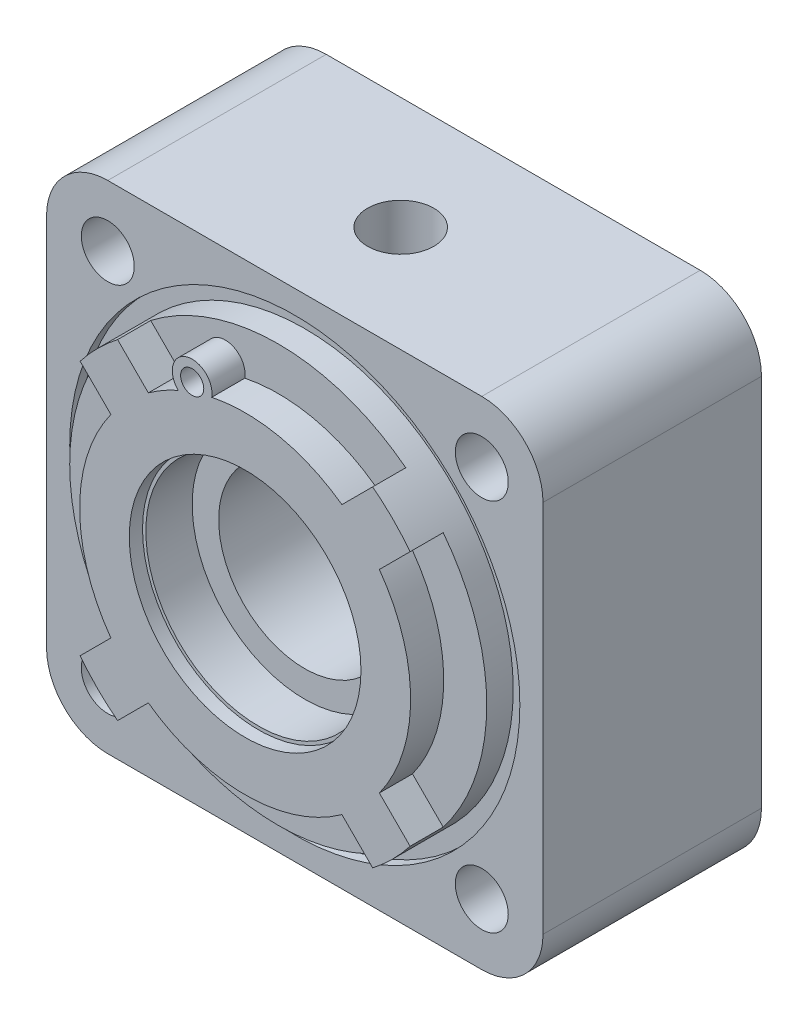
ISO-10303-21;
HEADER;
FILE_DESCRIPTION(('STEP AP214'),'2;1');
FILE_NAME('part.step','',(''),(''),'','','');
FILE_SCHEMA(('AUTOMOTIVE_DESIGN { 1 0 10303 214 1 1 1 1 }'));
ENDSEC;
DATA;
#1=APPLICATION_CONTEXT('core data for automotive mechanical design processes');
#2=APPLICATION_PROTOCOL_DEFINITION('international standard','automotive_design',2000,#1);
#3=PRODUCT_CONTEXT('',#1,'mechanical');
#4=PRODUCT('Part','Part','',(#3));
#5=PRODUCT_RELATED_PRODUCT_CATEGORY('part','',(#4));
#6=PRODUCT_DEFINITION_FORMATION('','',#4);
#7=PRODUCT_DEFINITION_CONTEXT('part definition',#1,'design');
#8=PRODUCT_DEFINITION('design','',#6,#7);
#9=PRODUCT_DEFINITION_SHAPE('','',#8);
#10=(LENGTH_UNIT() NAMED_UNIT(*) SI_UNIT(.MILLI.,.METRE.));
#11=(NAMED_UNIT(*) PLANE_ANGLE_UNIT() SI_UNIT($,.RADIAN.));
#12=(NAMED_UNIT(*) SI_UNIT($,.STERADIAN.) SOLID_ANGLE_UNIT());
#13=UNCERTAINTY_MEASURE_WITH_UNIT(LENGTH_MEASURE(1.E-05),#10,'distance_accuracy_value','');
#14=(GEOMETRIC_REPRESENTATION_CONTEXT(3) GLOBAL_UNCERTAINTY_ASSIGNED_CONTEXT((#13)) GLOBAL_UNIT_ASSIGNED_CONTEXT((#10,
#11,#12)) REPRESENTATION_CONTEXT('',''));
#15=CARTESIAN_POINT('',(0.,0.,0.));
#16=DIRECTION('',(0.,0.,1.));
#17=DIRECTION('',(1.,0.,0.));
#18=AXIS2_PLACEMENT_3D('',#15,#16,#17);
#19=CARTESIAN_POINT('',(0.,0.,-68.7695526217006));
#20=DIRECTION('',(0.,0.,1.));
#21=DIRECTION('',(1.,0.,0.));
#22=AXIS2_PLACEMENT_3D('',#19,#20,#21);
#23=CYLINDRICAL_SURFACE('',#22,13.);
#24=CARTESIAN_POINT('',(0.,0.,-0.5));
#25=DIRECTION('',(0.,0.,1.));
#26=DIRECTION('',(1.,0.,0.));
#27=AXIS2_PLACEMENT_3D('',#24,#25,#26);
#28=CIRCLE('',#27,13.);
#29=CARTESIAN_POINT('',(13.,0.,-0.5));
#30=VERTEX_POINT('',#29);
#31=EDGE_CURVE('E546',#30,#30,#28,.F.);
#32=ORIENTED_EDGE('',*,*,#31,.F.);
#33=EDGE_LOOP('',(#32));
#34=FACE_BOUND('',#33,.T.);
#35=CARTESIAN_POINT('',(0.,0.,-32.));
#36=DIRECTION('',(0.,0.,1.));
#37=DIRECTION('',(1.,0.,0.));
#38=AXIS2_PLACEMENT_3D('',#35,#36,#37);
#39=CIRCLE('',#38,13.);
#40=CARTESIAN_POINT('',(13.0000000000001,0.,-32.));
#41=VERTEX_POINT('',#40);
#42=EDGE_CURVE('E548',#41,#41,#39,.F.);
#43=ORIENTED_EDGE('',*,*,#42,.T.);
#44=EDGE_LOOP('',(#43));
#45=FACE_BOUND('',#44,.T.);
#46=DIRECTION('',(0.,0.,1.));
#47=VECTOR('',#46,1.);
#48=CARTESIAN_POINT('',(-3.57071421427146,12.4999999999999,-68.7695526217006));
#49=LINE('',#48,#47);
#50=CARTESIAN_POINT('',(-3.57071421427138,12.5,-11.5000000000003));
#51=VERTEX_POINT('',#50);
#52=CARTESIAN_POINT('',(-3.57071421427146,12.5,-18.5000000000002));
#53=VERTEX_POINT('',#52);
#54=EDGE_CURVE('E11',#51,#53,#49,.F.);
#55=ORIENTED_EDGE('',*,*,#54,.F.);
#56=CARTESIAN_POINT('',(-3.57071421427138,12.5,-11.5000000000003));
#57=CARTESIAN_POINT('',(-3.47355025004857,12.5277621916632,-11.4008635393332));
#58=CARTESIAN_POINT('',(-3.37223768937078,12.5554713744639,-11.3057713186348));
#59=CARTESIAN_POINT('',(-3.16190795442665,12.6100792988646,-11.1242259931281));
#60=CARTESIAN_POINT('',(-3.05288922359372,12.6369778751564,-11.0377746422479));
#61=CARTESIAN_POINT('',(-2.82755053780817,12.6893015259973,-10.8739357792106));
#62=CARTESIAN_POINT('',(-2.71121617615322,12.7147234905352,-10.7965670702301));
#63=CARTESIAN_POINT('',(-2.47214485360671,12.7633605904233,-10.6516630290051));
#64=CARTESIAN_POINT('',(-2.34940835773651,12.7865758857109,-10.5841269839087));
#65=CARTESIAN_POINT('',(-2.09806029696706,12.830215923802,-10.4593099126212));
#66=CARTESIAN_POINT('',(-1.96943847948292,12.8506355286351,-10.4020477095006));
#67=CARTESIAN_POINT('',(-1.70733768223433,12.8880768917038,-10.2984191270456));
#68=CARTESIAN_POINT('',(-1.57385693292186,12.9050973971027,-10.2520567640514));
#69=CARTESIAN_POINT('',(-1.30325980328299,12.9352237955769,-10.1707724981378));
#70=CARTESIAN_POINT('',(-1.16614967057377,12.9483359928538,-10.1358321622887));
#71=CARTESIAN_POINT('',(-0.889079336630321,12.9703065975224,-10.077644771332));
#72=CARTESIAN_POINT('',(-0.749118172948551,12.9791635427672,-10.0544017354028));
#73=CARTESIAN_POINT('',(-0.473862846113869,12.992058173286,-10.0206620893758));
#74=CARTESIAN_POINT('',(-0.338642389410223,12.9962949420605,-10.0096385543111));
#75=CARTESIAN_POINT('',(-0.0676350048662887,13.0005306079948,-9.99861792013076));
#76=CARTESIAN_POINT('',(0.0681521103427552,13.0005279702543,-9.99862481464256));
#77=CARTESIAN_POINT('',(0.339164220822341,12.9962813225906,-10.009673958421));
#78=CARTESIAN_POINT('',(0.47438938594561,12.992038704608,-10.0207125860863));
#79=CARTESIAN_POINT('',(0.743354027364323,12.9794283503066,-10.0537092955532));
#80=CARTESIAN_POINT('',(0.877092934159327,12.9710590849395,-10.0756714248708));
#81=CARTESIAN_POINT('',(1.13799748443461,12.9507353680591,-10.1294611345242));
#82=CARTESIAN_POINT('',(1.26523893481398,12.9388987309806,-10.1609655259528));
#83=CARTESIAN_POINT('',(1.51654579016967,12.9118589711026,-10.2337404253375));
#84=CARTESIAN_POINT('',(1.64061004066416,12.8966546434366,-10.2750144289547));
#85=CARTESIAN_POINT('',(2.00686448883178,12.846516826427,-10.4130141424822));
#86=CARTESIAN_POINT('',(2.2432590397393,12.8070467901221,-10.5239472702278));
#87=CARTESIAN_POINT('',(2.67209570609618,12.7241063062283,-10.7674397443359));
#88=CARTESIAN_POINT('',(2.86656946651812,12.6814293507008,-10.8967317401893));
#89=CARTESIAN_POINT('',(3.14275064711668,12.6147568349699,-11.1094207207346));
#90=CARTESIAN_POINT('',(3.23217157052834,12.5921048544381,-11.1833899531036));
#91=CARTESIAN_POINT('',(3.40558680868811,12.5463152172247,-11.3372943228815));
#92=CARTESIAN_POINT('',(3.48958126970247,12.5231775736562,-11.417229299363));
#93=CARTESIAN_POINT('',(3.57071421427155,12.4999999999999,-11.5));
#94=B_SPLINE_CURVE_WITH_KNOTS('',3,(#56,#57,#58,#59,#60,#61,#62,#63,#64,#65,#66,#67,#68,#69,#70,
#71,#72,#73,#74,#75,#76,#77,#78,#79,#80,#81,#82,#83,#84,#85,#86,#87,#88,#89,#90,#91,#92,#93),
.UNSPECIFIED.,.F.,.F.,(4,2,2,2,2,2,2,2,2,2,2,2,2,2,2,2,2,2,4),(0.,0.424574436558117,
0.849234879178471,1.27475951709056,1.70025328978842,2.12651883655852,2.55294120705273,
2.97867197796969,3.40454892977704,3.81124531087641,4.21808893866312,4.62479904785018,
5.0316599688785,5.42604403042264,5.82056942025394,6.60918681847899,7.31902534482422,
7.67350023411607,8.02796556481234),.UNSPECIFIED.);
#95=CARTESIAN_POINT('',(3.57071421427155,12.4999999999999,-11.5));
#96=VERTEX_POINT('',#95);
#97=EDGE_CURVE('E32',#51,#96,#94,.T.);
#98=ORIENTED_EDGE('',*,*,#97,.T.);
#99=DIRECTION('',(0.,0.,1.));
#100=VECTOR('',#99,1.);
#101=CARTESIAN_POINT('',(3.57071421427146,12.5,-68.7695526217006));
#102=LINE('',#101,#100);
#103=CARTESIAN_POINT('',(3.57071421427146,12.4999999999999,-18.5));
#104=VERTEX_POINT('',#103);
#105=EDGE_CURVE('E352',#104,#96,#102,.T.);
#106=ORIENTED_EDGE('',*,*,#105,.F.);
#107=CARTESIAN_POINT('',(3.57071421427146,12.4999999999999,-18.5));
#108=CARTESIAN_POINT('',(3.47355025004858,12.5277621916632,-18.5991364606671));
#109=CARTESIAN_POINT('',(3.37223768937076,12.5554713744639,-18.6942286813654));
#110=CARTESIAN_POINT('',(3.1619079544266,12.6100792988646,-18.8757740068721));
#111=CARTESIAN_POINT('',(3.05288922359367,12.6369778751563,-18.9622253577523));
#112=CARTESIAN_POINT('',(2.82755053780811,12.6893015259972,-19.1260642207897));
#113=CARTESIAN_POINT('',(2.71121617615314,12.7147234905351,-19.2034329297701));
#114=CARTESIAN_POINT('',(2.47214485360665,12.7633605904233,-19.3483369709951));
#115=CARTESIAN_POINT('',(2.34940835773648,12.786575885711,-19.4158730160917));
#116=CARTESIAN_POINT('',(2.09806029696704,12.8302159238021,-19.5406900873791));
#117=CARTESIAN_POINT('',(1.96943847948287,12.8506355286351,-19.5979522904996));
#118=CARTESIAN_POINT('',(1.70733768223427,12.8880768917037,-19.7015808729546));
#119=CARTESIAN_POINT('',(1.57385693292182,12.9050973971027,-19.7479432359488));
#120=CARTESIAN_POINT('',(1.30325980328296,12.9352237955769,-19.8292275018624));
#121=CARTESIAN_POINT('',(1.16614967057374,12.9483359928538,-19.8641678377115));
#122=CARTESIAN_POINT('',(0.889079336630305,12.9703065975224,-19.9223552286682));
#123=CARTESIAN_POINT('',(0.749118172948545,12.9791635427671,-19.9455982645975));
#124=CARTESIAN_POINT('',(0.473862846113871,12.9920581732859,-19.9793379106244));
#125=CARTESIAN_POINT('',(0.338642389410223,12.9962949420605,-19.9903614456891));
#126=CARTESIAN_POINT('',(0.0676350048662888,13.0005306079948,-20.0013820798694));
#127=CARTESIAN_POINT('',(-0.0681521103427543,13.0005279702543,-20.0013751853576));
#128=CARTESIAN_POINT('',(-0.33916422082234,12.9962813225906,-19.9903260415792));
#129=CARTESIAN_POINT('',(-0.47438938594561,12.992038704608,-19.9792874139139));
#130=CARTESIAN_POINT('',(-0.743354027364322,12.9794283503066,-19.946290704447));
#131=CARTESIAN_POINT('',(-0.877092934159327,12.9710590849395,-19.9243285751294));
#132=CARTESIAN_POINT('',(-1.13799748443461,12.9507353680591,-19.870538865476));
#133=CARTESIAN_POINT('',(-1.26523893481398,12.9388987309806,-19.8390344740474));
#134=CARTESIAN_POINT('',(-1.51654579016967,12.9118589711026,-19.7662595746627));
#135=CARTESIAN_POINT('',(-1.64061004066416,12.8966546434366,-19.7249855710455));
#136=CARTESIAN_POINT('',(-2.0068644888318,12.846516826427,-19.586985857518));
#137=CARTESIAN_POINT('',(-2.24325903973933,12.807046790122,-19.4760527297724));
#138=CARTESIAN_POINT('',(-2.67209570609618,12.7241063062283,-19.2325602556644));
#139=CARTESIAN_POINT('',(-2.86656946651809,12.6814293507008,-19.1032682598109));
#140=CARTESIAN_POINT('',(-3.14275064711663,12.61475683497,-18.8905792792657));
#141=CARTESIAN_POINT('',(-3.23217157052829,12.5921048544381,-18.8166100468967));
#142=CARTESIAN_POINT('',(-3.40558680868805,12.5463152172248,-18.6627056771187));
#143=CARTESIAN_POINT('',(-3.4895812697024,12.5231775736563,-18.5827707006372));
#144=CARTESIAN_POINT('',(-3.57071421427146,12.5,-18.5000000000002));
#145=B_SPLINE_CURVE_WITH_KNOTS('',3,(#107,#108,#109,#110,#111,#112,#113,#114,#115,#116,#117,
#118,#119,#120,#121,#122,#123,#124,#125,#126,#127,#128,#129,#130,#131,#132,#133,#134,#135,#136,
#137,#138,#139,#140,#141,#142,#143,#144),.UNSPECIFIED.,.F.,.F.,(4,2,2,2,2,2,2,2,2,2,2,2,2,2,2,2,
2,2,4),(0.,0.424574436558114,0.849234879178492,1.27475951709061,1.70025328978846,
2.12651883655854,2.55294120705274,2.97867197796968,3.40454892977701,3.81124531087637,
4.21808893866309,4.62479904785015,5.03165996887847,5.42604403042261,5.82056942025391,
6.60918681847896,7.31902534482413,7.67350023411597,8.02796556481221),.UNSPECIFIED.);
#146=EDGE_CURVE('E357',#104,#53,#145,.T.);
#147=ORIENTED_EDGE('',*,*,#146,.T.);
#148=EDGE_LOOP('',(#55,#98,#106,#147));
#149=FACE_BOUND('',#148,.T.);
#150=ADVANCED_FACE('F24',(#34,#45,#149),#23,.F.);
#151=CARTESIAN_POINT('',(0.,0.,3.5));
#152=DIRECTION('',(0.,0.,1.));
#153=DIRECTION('',(1.,0.,0.));
#154=AXIS2_PLACEMENT_3D('',#151,#152,#153);
#155=PLANE('',#154);
#156=DIRECTION('',(-0.707106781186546,0.707106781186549,0.));
#157=VECTOR('',#156,1.);
#158=CARTESIAN_POINT('',(-14.621501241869,20.2783554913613,3.5));
#159=LINE('',#158,#157);
#160=CARTESIAN_POINT('',(-14.621501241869,20.2783554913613,3.5));
#161=VERTEX_POINT('',#160);
#162=CARTESIAN_POINT('',(-19.2651239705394,24.9219782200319,3.5));
#163=VERTEX_POINT('',#162);
#164=EDGE_CURVE('E585',#161,#163,#159,.T.);
#165=ORIENTED_EDGE('',*,*,#164,.F.);
#166=CARTESIAN_POINT('',(0.,0.,3.5));
#167=DIRECTION('',(0.,0.,1.));
#168=DIRECTION('',(1.,0.,0.));
#169=AXIS2_PLACEMENT_3D('',#166,#167,#168);
#170=CIRCLE('',#169,25.);
#171=CARTESIAN_POINT('',(-10.1079981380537,22.8654405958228,3.5));
#172=VERTEX_POINT('',#171);
#173=EDGE_CURVE('E598',#172,#161,#170,.T.);
#174=ORIENTED_EDGE('',*,*,#173,.F.);
#175=CARTESIAN_POINT('',(-7.99999999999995,25.,3.5));
#176=DIRECTION('',(0.,0.,1.));
#177=DIRECTION('',(-1.,0.,0.));
#178=AXIS2_PLACEMENT_3D('',#175,#176,#177);
#179=CIRCLE('',#178,2.99999999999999);
#180=CARTESIAN_POINT('',(-5.04439663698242,24.4857930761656,3.5));
#181=VERTEX_POINT('',#180);
#182=EDGE_CURVE('E814',#181,#172,#179,.T.);
#183=ORIENTED_EDGE('',*,*,#182,.F.);
#184=CARTESIAN_POINT('',(0.,0.,3.5));
#185=DIRECTION('',(0.,0.,1.));
#186=DIRECTION('',(1.,0.,0.));
#187=AXIS2_PLACEMENT_3D('',#184,#185,#186);
#188=CIRCLE('',#187,25.);
#189=CARTESIAN_POINT('',(14.621501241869,20.2783554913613,3.49999999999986));
#190=VERTEX_POINT('',#189);
#191=EDGE_CURVE('E812',#190,#181,#188,.T.);
#192=ORIENTED_EDGE('',*,*,#191,.F.);
#193=DIRECTION('',(-0.707106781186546,-0.707106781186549,0.));
#194=VECTOR('',#193,1.);
#195=CARTESIAN_POINT('',(14.621501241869,20.2783554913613,3.49999999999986));
#196=LINE('',#195,#194);
#197=CARTESIAN_POINT('',(19.2651239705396,24.9219782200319,3.49999999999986));
#198=VERTEX_POINT('',#197);
#199=EDGE_CURVE('E784',#198,#190,#196,.T.);
#200=ORIENTED_EDGE('',*,*,#199,.F.);
#201=CARTESIAN_POINT('',(0.,0.,3.5));
#202=DIRECTION('',(0.,0.,1.));
#203=DIRECTION('',(1.,0.,0.));
#204=AXIS2_PLACEMENT_3D('',#201,#202,#203);
#205=CIRCLE('',#204,31.5);
#206=EDGE_CURVE('E679',#198,#163,#205,.T.);
#207=ORIENTED_EDGE('',*,*,#206,.T.);
#208=EDGE_LOOP('',(#165,#174,#183,#192,#200,#207));
#209=FACE_BOUND('',#208,.T.);
#210=ADVANCED_FACE('F534',(#209),#155,.T.);
#211=DIRECTION('',(0.707106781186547,0.707106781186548,0.));
#212=VECTOR('',#211,1.);
#213=CARTESIAN_POINT('',(20.2783554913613,14.6215012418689,3.49999999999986));
#214=LINE('',#213,#212);
#215=CARTESIAN_POINT('',(20.2783554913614,14.6215012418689,3.49999999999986));
#216=VERTEX_POINT('',#215);
#217=CARTESIAN_POINT('',(24.9219782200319,19.2651239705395,3.49999999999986));
#218=VERTEX_POINT('',#217);
#219=EDGE_CURVE('E770',#216,#218,#214,.T.);
#220=ORIENTED_EDGE('',*,*,#219,.F.);
#221=CARTESIAN_POINT('',(0.,0.,3.5));
#222=DIRECTION('',(0.,0.,1.));
#223=DIRECTION('',(1.,0.,0.));
#224=AXIS2_PLACEMENT_3D('',#221,#222,#223);
#225=CIRCLE('',#224,25.);
#226=CARTESIAN_POINT('',(20.2783554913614,-14.621501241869,3.49999999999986));
#227=VERTEX_POINT('',#226);
#228=EDGE_CURVE('E785',#227,#216,#225,.T.);
#229=ORIENTED_EDGE('',*,*,#228,.F.);
#230=DIRECTION('',(-0.707106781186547,0.707106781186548,0.));
#231=VECTOR('',#230,1.);
#232=CARTESIAN_POINT('',(20.2783554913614,-14.621501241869,3.49999999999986));
#233=LINE('',#232,#231);
#234=CARTESIAN_POINT('',(24.9219782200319,-19.2651239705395,3.49999999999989));
#235=VERTEX_POINT('',#234);
#236=EDGE_CURVE('E773',#235,#227,#233,.T.);
#237=ORIENTED_EDGE('',*,*,#236,.F.);
#238=EDGE_CURVE('E571',#235,#218,#205,.T.);
#239=ORIENTED_EDGE('',*,*,#238,.T.);
#240=EDGE_LOOP('',(#220,#229,#237,#239));
#241=FACE_BOUND('',#240,.T.);
#242=ADVANCED_FACE('F539',(#241),#155,.T.);
#243=DIRECTION('',(0.707106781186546,-0.707106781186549,0.));
#244=VECTOR('',#243,1.);
#245=CARTESIAN_POINT('',(14.621501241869,-20.2783554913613,3.49999999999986));
#246=LINE('',#245,#244);
#247=CARTESIAN_POINT('',(14.621501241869,-20.2783554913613,3.49999999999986));
#248=VERTEX_POINT('',#247);
#249=CARTESIAN_POINT('',(19.2651239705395,-24.9219782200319,3.49999999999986));
#250=VERTEX_POINT('',#249);
#251=EDGE_CURVE('E800',#248,#250,#246,.T.);
#252=ORIENTED_EDGE('',*,*,#251,.F.);
#253=CARTESIAN_POINT('',(0.,0.,3.5));
#254=DIRECTION('',(0.,0.,1.));
#255=DIRECTION('',(1.,0.,0.));
#256=AXIS2_PLACEMENT_3D('',#253,#254,#255);
#257=CIRCLE('',#256,25.);
#258=CARTESIAN_POINT('',(-14.6215012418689,-20.2783554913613,3.5));
#259=VERTEX_POINT('',#258);
#260=EDGE_CURVE('E564',#259,#248,#257,.T.);
#261=ORIENTED_EDGE('',*,*,#260,.F.);
#262=DIRECTION('',(0.707106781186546,0.707106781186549,0.));
#263=VECTOR('',#262,1.);
#264=CARTESIAN_POINT('',(-14.6215012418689,-20.2783554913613,3.5));
#265=LINE('',#264,#263);
#266=CARTESIAN_POINT('',(-19.2651239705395,-24.9219782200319,3.5));
#267=VERTEX_POINT('',#266);
#268=EDGE_CURVE('E570',#267,#259,#265,.T.);
#269=ORIENTED_EDGE('',*,*,#268,.F.);
#270=EDGE_CURVE('E763',#267,#250,#205,.T.);
#271=ORIENTED_EDGE('',*,*,#270,.T.);
#272=EDGE_LOOP('',(#252,#261,#269,#271));
#273=FACE_BOUND('',#272,.T.);
#274=ADVANCED_FACE('F884',(#273),#155,.T.);
#275=CARTESIAN_POINT('',(0.,0.,-0.5));
#276=DIRECTION('',(0.,0.,1.));
#277=DIRECTION('',(1.,0.,0.));
#278=AXIS2_PLACEMENT_3D('',#275,#276,#277);
#279=PLANE('',#278);
#280=CARTESIAN_POINT('',(0.,0.,-0.5));
#281=DIRECTION('',(0.,0.,1.));
#282=DIRECTION('',(1.,0.,0.));
#283=AXIS2_PLACEMENT_3D('',#280,#281,#282);
#284=CIRCLE('',#283,34.);
#285=CARTESIAN_POINT('',(34.,0.,-0.5));
#286=VERTEX_POINT('',#285);
#287=EDGE_CURVE('E678',#286,#286,#284,.T.);
#288=ORIENTED_EDGE('',*,*,#287,.T.);
#289=EDGE_LOOP('',(#288));
#290=FACE_BOUND('',#289,.T.);
#291=CARTESIAN_POINT('',(0.,0.,-0.5));
#292=DIRECTION('',(0.,0.,1.));
#293=DIRECTION('',(1.,0.,0.));
#294=AXIS2_PLACEMENT_3D('',#291,#292,#293);
#295=CIRCLE('',#294,31.5);
#296=CARTESIAN_POINT('',(31.5,0.,-0.5));
#297=VERTEX_POINT('',#296);
#298=EDGE_CURVE('E672',#297,#297,#295,.T.);
#299=ORIENTED_EDGE('',*,*,#298,.F.);
#300=EDGE_LOOP('',(#299));
#301=FACE_BOUND('',#300,.T.);
#302=ADVANCED_FACE('F888',(#290,#301),#279,.T.);
#303=CARTESIAN_POINT('',(-37.5,-37.5,-32.));
#304=DIRECTION('',(0.,0.,1.));
#305=DIRECTION('',(1.,0.,0.));
#306=AXIS2_PLACEMENT_3D('',#303,#304,#305);
#307=PLANE('',#306);
#308=DIRECTION('',(-1.,0.,0.));
#309=VECTOR('',#308,1.);
#310=CARTESIAN_POINT('',(-37.5,29.9999999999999,-32.));
#311=LINE('',#310,#309);
#312=CARTESIAN_POINT('',(13.,30.,-32.));
#313=VERTEX_POINT('',#312);
#314=CARTESIAN_POINT('',(-13.,30.,-32.0000000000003));
#315=VERTEX_POINT('',#314);
#316=EDGE_CURVE('E740',#313,#315,#311,.T.);
#317=ORIENTED_EDGE('',*,*,#316,.T.);
#318=CARTESIAN_POINT('',(-13.,28.,-32.0000000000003));
#319=DIRECTION('',(0.,0.,1.));
#320=DIRECTION('',(1.,0.,0.));
#321=AXIS2_PLACEMENT_3D('',#318,#319,#320);
#322=CIRCLE('',#321,2.);
#323=CARTESIAN_POINT('',(-15.,28.,-32.0000000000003));
#324=VERTEX_POINT('',#323);
#325=EDGE_CURVE('E985',#315,#324,#322,.T.);
#326=ORIENTED_EDGE('',*,*,#325,.T.);
#327=DIRECTION('',(0.,-1.,0.));
#328=VECTOR('',#327,1.);
#329=CARTESIAN_POINT('',(-14.9999999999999,-37.5,-32.0000000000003));
#330=LINE('',#329,#328);
#331=CARTESIAN_POINT('',(-15.,24.5,-32.0000000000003));
#332=VERTEX_POINT('',#331);
#333=EDGE_CURVE('E1042',#324,#332,#330,.T.);
#334=ORIENTED_EDGE('',*,*,#333,.T.);
#335=CARTESIAN_POINT('',(-24.5,24.5,-32.));
#336=DIRECTION('',(0.,0.,1.));
#337=DIRECTION('',(1.,0.,0.));
#338=AXIS2_PLACEMENT_3D('',#335,#336,#337);
#339=CIRCLE('',#338,9.50000000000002);
#340=CARTESIAN_POINT('',(-24.5,15.,-32.));
#341=VERTEX_POINT('',#340);
#342=EDGE_CURVE('E1045',#332,#341,#339,.F.);
#343=ORIENTED_EDGE('',*,*,#342,.T.);
#344=DIRECTION('',(-1.,0.,0.));
#345=VECTOR('',#344,1.);
#346=CARTESIAN_POINT('',(-37.5,15.,-32.));
#347=LINE('',#346,#345);
#348=CARTESIAN_POINT('',(-28.,14.9999999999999,-32.));
#349=VERTEX_POINT('',#348);
#350=EDGE_CURVE('E1048',#341,#349,#347,.T.);
#351=ORIENTED_EDGE('',*,*,#350,.T.);
#352=CARTESIAN_POINT('',(-28.,12.9999999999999,-32.));
#353=DIRECTION('',(0.,0.,1.));
#354=DIRECTION('',(1.,0.,0.));
#355=AXIS2_PLACEMENT_3D('',#352,#353,#354);
#356=CIRCLE('',#355,2.);
#357=CARTESIAN_POINT('',(-30.,12.9999999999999,-32.));
#358=VERTEX_POINT('',#357);
#359=EDGE_CURVE('E1051',#349,#358,#356,.T.);
#360=ORIENTED_EDGE('',*,*,#359,.T.);
#361=DIRECTION('',(0.,-1.,0.));
#362=VECTOR('',#361,1.);
#363=CARTESIAN_POINT('',(-30.,-37.5,-32.));
#364=LINE('',#363,#362);
#365=CARTESIAN_POINT('',(-30.,-13.,-32.));
#366=VERTEX_POINT('',#365);
#367=EDGE_CURVE('E1054',#358,#366,#364,.T.);
#368=ORIENTED_EDGE('',*,*,#367,.T.);
#369=CARTESIAN_POINT('',(-28.,-13.,-32.));
#370=DIRECTION('',(0.,0.,1.));
#371=DIRECTION('',(1.,0.,0.));
#372=AXIS2_PLACEMENT_3D('',#369,#370,#371);
#373=CIRCLE('',#372,2.);
#374=CARTESIAN_POINT('',(-28.,-15.,-32.));
#375=VERTEX_POINT('',#374);
#376=EDGE_CURVE('E1057',#366,#375,#373,.T.);
#377=ORIENTED_EDGE('',*,*,#376,.T.);
#378=DIRECTION('',(1.,0.,0.));
#379=VECTOR('',#378,1.);
#380=CARTESIAN_POINT('',(-37.5,-14.9999999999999,-32.));
#381=LINE('',#380,#379);
#382=CARTESIAN_POINT('',(-24.5,-15.,-32.));
#383=VERTEX_POINT('',#382);
#384=EDGE_CURVE('E1060',#375,#383,#381,.T.);
#385=ORIENTED_EDGE('',*,*,#384,.T.);
#386=CARTESIAN_POINT('',(-24.5,-24.5,-32.));
#387=DIRECTION('',(0.,0.,1.));
#388=DIRECTION('',(1.,0.,0.));
#389=AXIS2_PLACEMENT_3D('',#386,#387,#388);
#390=CIRCLE('',#389,9.50000000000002);
#391=CARTESIAN_POINT('',(-15.,-24.5,-32.0000000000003));
#392=VERTEX_POINT('',#391);
#393=EDGE_CURVE('E1063',#383,#392,#390,.F.);
#394=ORIENTED_EDGE('',*,*,#393,.T.);
#395=DIRECTION('',(0.,-1.,0.));
#396=VECTOR('',#395,1.);
#397=CARTESIAN_POINT('',(-15.,-37.5,-32.0000000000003));
#398=LINE('',#397,#396);
#399=CARTESIAN_POINT('',(-15.,-28.,-32.0000000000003));
#400=VERTEX_POINT('',#399);
#401=EDGE_CURVE('E1066',#392,#400,#398,.T.);
#402=ORIENTED_EDGE('',*,*,#401,.T.);
#403=CARTESIAN_POINT('',(-13.,-28.,-32.0000000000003));
#404=DIRECTION('',(0.,0.,1.));
#405=DIRECTION('',(1.,0.,0.));
#406=AXIS2_PLACEMENT_3D('',#403,#404,#405);
#407=CIRCLE('',#406,2.);
#408=CARTESIAN_POINT('',(-13.,-30.,-32.0000000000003));
#409=VERTEX_POINT('',#408);
#410=EDGE_CURVE('E1069',#400,#409,#407,.T.);
#411=ORIENTED_EDGE('',*,*,#410,.T.);
#412=DIRECTION('',(1.,0.,0.));
#413=VECTOR('',#412,1.);
#414=CARTESIAN_POINT('',(-37.5,-30.,-32.));
#415=LINE('',#414,#413);
#416=CARTESIAN_POINT('',(13.,-30.,-32.));
#417=VERTEX_POINT('',#416);
#418=EDGE_CURVE('E1072',#409,#417,#415,.T.);
#419=ORIENTED_EDGE('',*,*,#418,.T.);
#420=CARTESIAN_POINT('',(13.,-28.,-32.));
#421=DIRECTION('',(0.,0.,1.));
#422=DIRECTION('',(1.,0.,0.));
#423=AXIS2_PLACEMENT_3D('',#420,#421,#422);
#424=CIRCLE('',#423,2.);
#425=CARTESIAN_POINT('',(15.,-28.,-32.));
#426=VERTEX_POINT('',#425);
#427=EDGE_CURVE('E1075',#417,#426,#424,.T.);
#428=ORIENTED_EDGE('',*,*,#427,.T.);
#429=DIRECTION('',(0.,1.,0.));
#430=VECTOR('',#429,1.);
#431=CARTESIAN_POINT('',(15.,-37.5,-32.));
#432=LINE('',#431,#430);
#433=CARTESIAN_POINT('',(15.,-24.5,-32.));
#434=VERTEX_POINT('',#433);
#435=EDGE_CURVE('E1078',#426,#434,#432,.T.);
#436=ORIENTED_EDGE('',*,*,#435,.T.);
#437=CARTESIAN_POINT('',(24.5,-24.5,-32.));
#438=DIRECTION('',(0.,0.,1.));
#439=DIRECTION('',(1.,0.,0.));
#440=AXIS2_PLACEMENT_3D('',#437,#438,#439);
#441=CIRCLE('',#440,9.50000000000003);
#442=CARTESIAN_POINT('',(24.5,-15.,-32.));
#443=VERTEX_POINT('',#442);
#444=EDGE_CURVE('E1081',#434,#443,#441,.F.);
#445=ORIENTED_EDGE('',*,*,#444,.T.);
#446=DIRECTION('',(1.,0.,0.));
#447=VECTOR('',#446,1.);
#448=CARTESIAN_POINT('',(-37.5,-15.,-32.));
#449=LINE('',#448,#447);
#450=CARTESIAN_POINT('',(28.,-15.,-32.));
#451=VERTEX_POINT('',#450);
#452=EDGE_CURVE('E1084',#443,#451,#449,.T.);
#453=ORIENTED_EDGE('',*,*,#452,.T.);
#454=CARTESIAN_POINT('',(28.,-13.,-32.));
#455=DIRECTION('',(0.,0.,1.));
#456=DIRECTION('',(1.,0.,0.));
#457=AXIS2_PLACEMENT_3D('',#454,#455,#456);
#458=CIRCLE('',#457,2.);
#459=CARTESIAN_POINT('',(30.,-13.,-32.));
#460=VERTEX_POINT('',#459);
#461=EDGE_CURVE('E1087',#451,#460,#458,.T.);
#462=ORIENTED_EDGE('',*,*,#461,.T.);
#463=DIRECTION('',(0.,1.,0.));
#464=VECTOR('',#463,1.);
#465=CARTESIAN_POINT('',(30.,-37.5,-32.));
#466=LINE('',#465,#464);
#467=CARTESIAN_POINT('',(30.,12.9999999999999,-32.));
#468=VERTEX_POINT('',#467);
#469=EDGE_CURVE('E1090',#460,#468,#466,.T.);
#470=ORIENTED_EDGE('',*,*,#469,.T.);
#471=CARTESIAN_POINT('',(28.,12.9999999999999,-32.));
#472=DIRECTION('',(0.,0.,1.));
#473=DIRECTION('',(1.,0.,0.));
#474=AXIS2_PLACEMENT_3D('',#471,#472,#473);
#475=CIRCLE('',#474,2.);
#476=CARTESIAN_POINT('',(28.,14.9999999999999,-32.));
#477=VERTEX_POINT('',#476);
#478=EDGE_CURVE('E1093',#468,#477,#475,.T.);
#479=ORIENTED_EDGE('',*,*,#478,.T.);
#480=DIRECTION('',(-1.,0.,0.));
#481=VECTOR('',#480,1.);
#482=CARTESIAN_POINT('',(-37.5,15.,-32.));
#483=LINE('',#482,#481);
#484=CARTESIAN_POINT('',(24.5,15.,-32.));
#485=VERTEX_POINT('',#484);
#486=EDGE_CURVE('E1096',#477,#485,#483,.T.);
#487=ORIENTED_EDGE('',*,*,#486,.T.);
#488=CARTESIAN_POINT('',(24.5,24.5,-32.));
#489=DIRECTION('',(0.,0.,1.));
#490=DIRECTION('',(1.,0.,0.));
#491=AXIS2_PLACEMENT_3D('',#488,#489,#490);
#492=CIRCLE('',#491,9.50000000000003);
#493=CARTESIAN_POINT('',(15.,24.5,-32.));
#494=VERTEX_POINT('',#493);
#495=EDGE_CURVE('E1099',#485,#494,#492,.F.);
#496=ORIENTED_EDGE('',*,*,#495,.T.);
#497=DIRECTION('',(0.,1.,0.));
#498=VECTOR('',#497,1.);
#499=CARTESIAN_POINT('',(15.,-37.5,-32.));
#500=LINE('',#499,#498);
#501=CARTESIAN_POINT('',(15.,28.,-32.));
#502=VERTEX_POINT('',#501);
#503=EDGE_CURVE('E1102',#494,#502,#500,.T.);
#504=ORIENTED_EDGE('',*,*,#503,.T.);
#505=CARTESIAN_POINT('',(13.,28.,-32.));
#506=DIRECTION('',(0.,0.,1.));
#507=DIRECTION('',(1.,0.,0.));
#508=AXIS2_PLACEMENT_3D('',#505,#506,#507);
#509=CIRCLE('',#508,2.);
#510=EDGE_CURVE('E1105',#502,#313,#509,.T.);
#511=ORIENTED_EDGE('',*,*,#510,.T.);
#512=EDGE_LOOP('',(#317,#326,#334,#343,#351,#360,#368,#377,#385,#394,#402,#411,#419,#428,#436,
#445,#453,#462,#470,#479,#487,#496,#504,#511));
#513=FACE_BOUND('',#512,.T.);
#514=CARTESIAN_POINT('',(28.25,-28.25,-32.));
#515=DIRECTION('',(0.,0.,1.));
#516=DIRECTION('',(1.,0.,0.));
#517=AXIS2_PLACEMENT_3D('',#514,#515,#516);
#518=CIRCLE('',#517,6.50000000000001);
#519=CARTESIAN_POINT('',(34.75,-28.25,-32.));
#520=VERTEX_POINT('',#519);
#521=EDGE_CURVE('E701',#520,#520,#518,.T.);
#522=ORIENTED_EDGE('',*,*,#521,.T.);
#523=EDGE_LOOP('',(#522));
#524=FACE_BOUND('',#523,.T.);
#525=CARTESIAN_POINT('',(-28.25,-28.25,-32.));
#526=DIRECTION('',(0.,0.,1.));
#527=DIRECTION('',(1.,0.,0.));
#528=AXIS2_PLACEMENT_3D('',#525,#526,#527);
#529=CIRCLE('',#528,6.5);
#530=CARTESIAN_POINT('',(-21.75,-28.25,-32.));
#531=VERTEX_POINT('',#530);
#532=EDGE_CURVE('E705',#531,#531,#529,.T.);
#533=ORIENTED_EDGE('',*,*,#532,.T.);
#534=EDGE_LOOP('',(#533));
#535=FACE_BOUND('',#534,.T.);
#536=CARTESIAN_POINT('',(-28.25,28.25,-32.));
#537=DIRECTION('',(0.,0.,1.));
#538=DIRECTION('',(1.,0.,0.));
#539=AXIS2_PLACEMENT_3D('',#536,#537,#538);
#540=CIRCLE('',#539,6.50000000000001);
#541=CARTESIAN_POINT('',(-21.75,28.25,-32.));
#542=VERTEX_POINT('',#541);
#543=EDGE_CURVE('E709',#542,#542,#540,.T.);
#544=ORIENTED_EDGE('',*,*,#543,.T.);
#545=EDGE_LOOP('',(#544));
#546=FACE_BOUND('',#545,.T.);
#547=CARTESIAN_POINT('',(28.25,28.25,-32.));
#548=DIRECTION('',(0.,0.,1.));
#549=DIRECTION('',(1.,0.,0.));
#550=AXIS2_PLACEMENT_3D('',#547,#548,#549);
#551=CIRCLE('',#550,6.50000000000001);
#552=CARTESIAN_POINT('',(34.75,28.25,-32.));
#553=VERTEX_POINT('',#552);
#554=EDGE_CURVE('E713',#553,#553,#551,.T.);
#555=ORIENTED_EDGE('',*,*,#554,.T.);
#556=EDGE_LOOP('',(#555));
#557=FACE_BOUND('',#556,.T.);
#558=DIRECTION('',(0.,1.,0.));
#559=VECTOR('',#558,1.);
#560=CARTESIAN_POINT('',(37.5,37.5,-32.));
#561=LINE('',#560,#559);
#562=CARTESIAN_POINT('',(37.5,-28.25,-32.));
#563=VERTEX_POINT('',#562);
#564=CARTESIAN_POINT('',(37.5,28.25,-32.));
#565=VERTEX_POINT('',#564);
#566=EDGE_CURVE('E735',#563,#565,#561,.T.);
#567=ORIENTED_EDGE('',*,*,#566,.F.);
#568=CARTESIAN_POINT('',(28.25,-28.25,-32.));
#569=DIRECTION('',(0.,0.,1.));
#570=DIRECTION('',(1.,0.,0.));
#571=AXIS2_PLACEMENT_3D('',#568,#569,#570);
#572=CIRCLE('',#571,9.25);
#573=CARTESIAN_POINT('',(28.25,-37.5,-32.));
#574=VERTEX_POINT('',#573);
#575=EDGE_CURVE('E979',#563,#574,#572,.F.);
#576=ORIENTED_EDGE('',*,*,#575,.T.);
#577=DIRECTION('',(1.,0.,0.));
#578=VECTOR('',#577,1.);
#579=CARTESIAN_POINT('',(-37.5,-37.5,-32.));
#580=LINE('',#579,#578);
#581=CARTESIAN_POINT('',(-28.25,-37.5,-32.));
#582=VERTEX_POINT('',#581);
#583=EDGE_CURVE('E732',#582,#574,#580,.T.);
#584=ORIENTED_EDGE('',*,*,#583,.F.);
#585=CARTESIAN_POINT('',(-28.25,-28.25,-32.));
#586=DIRECTION('',(0.,0.,1.));
#587=DIRECTION('',(1.,0.,0.));
#588=AXIS2_PLACEMENT_3D('',#585,#586,#587);
#589=CIRCLE('',#588,9.25);
#590=CARTESIAN_POINT('',(-37.5,-28.25,-32.));
#591=VERTEX_POINT('',#590);
#592=EDGE_CURVE('E1001',#582,#591,#589,.F.);
#593=ORIENTED_EDGE('',*,*,#592,.T.);
#594=DIRECTION('',(0.,-1.,0.));
#595=VECTOR('',#594,1.);
#596=CARTESIAN_POINT('',(-37.5,37.5,-32.));
#597=LINE('',#596,#595);
#598=CARTESIAN_POINT('',(-37.5,28.2499999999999,-32.));
#599=VERTEX_POINT('',#598);
#600=EDGE_CURVE('E729',#599,#591,#597,.T.);
#601=ORIENTED_EDGE('',*,*,#600,.F.);
#602=CARTESIAN_POINT('',(-28.25,28.25,-32.));
#603=DIRECTION('',(0.,0.,1.));
#604=DIRECTION('',(1.,0.,0.));
#605=AXIS2_PLACEMENT_3D('',#602,#603,#604);
#606=CIRCLE('',#605,9.25);
#607=CARTESIAN_POINT('',(-28.25,37.5,-32.));
#608=VERTEX_POINT('',#607);
#609=EDGE_CURVE('E46',#599,#608,#606,.F.);
#610=ORIENTED_EDGE('',*,*,#609,.T.);
#611=DIRECTION('',(-1.,0.,0.));
#612=VECTOR('',#611,1.);
#613=CARTESIAN_POINT('',(-37.5,37.5,-32.));
#614=LINE('',#613,#612);
#615=CARTESIAN_POINT('',(28.25,37.5,-32.));
#616=VERTEX_POINT('',#615);
#617=EDGE_CURVE('E738',#616,#608,#614,.T.);
#618=ORIENTED_EDGE('',*,*,#617,.F.);
#619=CARTESIAN_POINT('',(28.25,28.25,-32.));
#620=DIRECTION('',(0.,0.,1.));
#621=DIRECTION('',(1.,0.,0.));
#622=AXIS2_PLACEMENT_3D('',#619,#620,#621);
#623=CIRCLE('',#622,9.25);
#624=EDGE_CURVE('E999',#616,#565,#623,.F.);
#625=ORIENTED_EDGE('',*,*,#624,.T.);
#626=EDGE_LOOP('',(#567,#576,#584,#593,#601,#610,#618,#625));
#627=FACE_BOUND('',#626,.T.);
#628=ADVANCED_FACE('F891',(#513,#524,#535,#546,#557,#627),#307,.F.);
#629=CARTESIAN_POINT('',(-37.5,37.5,-32.));
#630=DIRECTION('',(-1.,0.,0.));
#631=DIRECTION('',(0.,-1.,0.));
#632=AXIS2_PLACEMENT_3D('',#629,#630,#631);
#633=PLANE('',#632);
#634=ORIENTED_EDGE('',*,*,#600,.T.);
#635=DIRECTION('',(0.,0.,1.));
#636=VECTOR('',#635,1.);
#637=CARTESIAN_POINT('',(-37.5,-28.25,-32.));
#638=LINE('',#637,#636);
#639=CARTESIAN_POINT('',(-37.5,-28.25,0.999999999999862));
#640=VERTEX_POINT('',#639);
#641=EDGE_CURVE('E1006',#591,#640,#638,.T.);
#642=ORIENTED_EDGE('',*,*,#641,.T.);
#643=DIRECTION('',(0.,-1.,0.));
#644=VECTOR('',#643,1.);
#645=CARTESIAN_POINT('',(-37.5,37.5,0.999999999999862));
#646=LINE('',#645,#644);
#647=CARTESIAN_POINT('',(-37.5,28.25,0.999999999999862));
#648=VERTEX_POINT('',#647);
#649=EDGE_CURVE('E717',#648,#640,#646,.T.);
#650=ORIENTED_EDGE('',*,*,#649,.F.);
#651=DIRECTION('',(0.,0.,1.));
#652=VECTOR('',#651,1.);
#653=CARTESIAN_POINT('',(-37.5,28.2499999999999,-32.));
#654=LINE('',#653,#652);
#655=EDGE_CURVE('E1004',#648,#599,#654,.F.);
#656=ORIENTED_EDGE('',*,*,#655,.T.);
#657=EDGE_LOOP('',(#634,#642,#650,#656));
#658=FACE_BOUND('',#657,.T.);
#659=ADVANCED_FACE('F26',(#658),#633,.T.);
#660=CARTESIAN_POINT('',(-37.5,37.5,-32.));
#661=DIRECTION('',(0.,1.,0.));
#662=DIRECTION('',(0.,0.,1.));
#663=AXIS2_PLACEMENT_3D('',#660,#661,#662);
#664=PLANE('',#663);
#665=CARTESIAN_POINT('',(0.,37.5,-15.0000000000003));
#666=DIRECTION('',(0.,1.,0.));
#667=DIRECTION('',(0.,0.,1.));
#668=AXIS2_PLACEMENT_3D('',#665,#666,#667);
#669=CIRCLE('',#668,5.);
#670=CARTESIAN_POINT('',(0.,37.5,-10.0000000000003));
#671=VERTEX_POINT('',#670);
#672=EDGE_CURVE('E364',#671,#671,#669,.T.);
#673=ORIENTED_EDGE('',*,*,#672,.F.);
#674=EDGE_LOOP('',(#673));
#675=FACE_BOUND('',#674,.T.);
#676=DIRECTION('',(-1.,0.,0.));
#677=VECTOR('',#676,1.);
#678=CARTESIAN_POINT('',(-37.5,37.5,0.999999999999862));
#679=LINE('',#678,#677);
#680=CARTESIAN_POINT('',(28.25,37.5,0.999999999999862));
#681=VERTEX_POINT('',#680);
#682=CARTESIAN_POINT('',(-28.25,37.5,0.999999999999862));
#683=VERTEX_POINT('',#682);
#684=EDGE_CURVE('E726',#681,#683,#679,.T.);
#685=ORIENTED_EDGE('',*,*,#684,.F.);
#686=DIRECTION('',(0.,0.,1.));
#687=VECTOR('',#686,1.);
#688=CARTESIAN_POINT('',(28.25,37.5,-32.));
#689=LINE('',#688,#687);
#690=EDGE_CURVE('E358',#681,#616,#689,.F.);
#691=ORIENTED_EDGE('',*,*,#690,.T.);
#692=ORIENTED_EDGE('',*,*,#617,.T.);
#693=DIRECTION('',(0.,0.,1.));
#694=VECTOR('',#693,1.);
#695=CARTESIAN_POINT('',(-28.25,37.5,-32.));
#696=LINE('',#695,#694);
#697=EDGE_CURVE('E1009',#608,#683,#696,.T.);
#698=ORIENTED_EDGE('',*,*,#697,.T.);
#699=EDGE_LOOP('',(#685,#691,#692,#698));
#700=FACE_BOUND('',#699,.T.);
#701=ADVANCED_FACE('F958',(#675,#700),#664,.T.);
#702=CARTESIAN_POINT('',(37.5,37.5,-32.));
#703=DIRECTION('',(1.,0.,0.));
#704=DIRECTION('',(0.,1.,0.));
#705=AXIS2_PLACEMENT_3D('',#702,#703,#704);
#706=PLANE('',#705);
#707=DIRECTION('',(0.,1.,0.));
#708=VECTOR('',#707,1.);
#709=CARTESIAN_POINT('',(37.5,37.5,1.));
#710=LINE('',#709,#708);
#711=CARTESIAN_POINT('',(37.5,-28.25,1.));
#712=VERTEX_POINT('',#711);
#713=CARTESIAN_POINT('',(37.5,28.25,1.));
#714=VERTEX_POINT('',#713);
#715=EDGE_CURVE('E723',#712,#714,#710,.T.);
#716=ORIENTED_EDGE('',*,*,#715,.F.);
#717=DIRECTION('',(0.,0.,1.));
#718=VECTOR('',#717,1.);
#719=CARTESIAN_POINT('',(37.5,-28.25,-32.));
#720=LINE('',#719,#718);
#721=EDGE_CURVE('E996',#712,#563,#720,.F.);
#722=ORIENTED_EDGE('',*,*,#721,.T.);
#723=ORIENTED_EDGE('',*,*,#566,.T.);
#724=DIRECTION('',(0.,0.,1.));
#725=VECTOR('',#724,1.);
#726=CARTESIAN_POINT('',(37.5,28.25,-32.));
#727=LINE('',#726,#725);
#728=EDGE_CURVE('E993',#565,#714,#727,.T.);
#729=ORIENTED_EDGE('',*,*,#728,.T.);
#730=EDGE_LOOP('',(#716,#722,#723,#729));
#731=FACE_BOUND('',#730,.T.);
#732=ADVANCED_FACE('F961',(#731),#706,.T.);
#733=CARTESIAN_POINT('',(-37.5,-37.5,-32.));
#734=DIRECTION('',(0.,-1.,0.));
#735=DIRECTION('',(0.,0.,-1.));
#736=AXIS2_PLACEMENT_3D('',#733,#734,#735);
#737=PLANE('',#736);
#738=ORIENTED_EDGE('',*,*,#583,.T.);
#739=DIRECTION('',(0.,0.,1.));
#740=VECTOR('',#739,1.);
#741=CARTESIAN_POINT('',(28.25,-37.5,-32.));
#742=LINE('',#741,#740);
#743=CARTESIAN_POINT('',(28.2500000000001,-37.5,1.));
#744=VERTEX_POINT('',#743);
#745=EDGE_CURVE('E973',#574,#744,#742,.T.);
#746=ORIENTED_EDGE('',*,*,#745,.T.);
#747=DIRECTION('',(1.,0.,0.));
#748=VECTOR('',#747,1.);
#749=CARTESIAN_POINT('',(-37.5,-37.5,0.999999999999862));
#750=LINE('',#749,#748);
#751=CARTESIAN_POINT('',(-28.2499999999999,-37.5,1.));
#752=VERTEX_POINT('',#751);
#753=EDGE_CURVE('E720',#752,#744,#750,.T.);
#754=ORIENTED_EDGE('',*,*,#753,.F.);
#755=DIRECTION('',(0.,0.,1.));
#756=VECTOR('',#755,1.);
#757=CARTESIAN_POINT('',(-28.25,-37.5,-32.));
#758=LINE('',#757,#756);
#759=EDGE_CURVE('E975',#752,#582,#758,.F.);
#760=ORIENTED_EDGE('',*,*,#759,.T.);
#761=EDGE_LOOP('',(#738,#746,#754,#760));
#762=FACE_BOUND('',#761,.T.);
#763=ADVANCED_FACE('F953',(#762),#737,.T.);
#764=CARTESIAN_POINT('',(-37.5,-37.5,0.999999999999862));
#765=DIRECTION('',(0.,0.,1.));
#766=DIRECTION('',(1.,0.,0.));
#767=AXIS2_PLACEMENT_3D('',#764,#765,#766);
#768=PLANE('',#767);
#769=CARTESIAN_POINT('',(0.,0.,1.));
#770=DIRECTION('',(0.,0.,1.));
#771=DIRECTION('',(1.,0.,0.));
#772=AXIS2_PLACEMENT_3D('',#769,#770,#771);
#773=CIRCLE('',#772,34.);
#774=CARTESIAN_POINT('',(34.,0.,1.));
#775=VERTEX_POINT('',#774);
#776=EDGE_CURVE('E675',#775,#775,#773,.T.);
#777=ORIENTED_EDGE('',*,*,#776,.F.);
#778=EDGE_LOOP('',(#777));
#779=FACE_BOUND('',#778,.T.);
#780=CARTESIAN_POINT('',(28.2500000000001,-28.2500000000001,1.));
#781=DIRECTION('',(0.,0.,-1.));
#782=DIRECTION('',(1.,0.,0.));
#783=AXIS2_PLACEMENT_3D('',#780,#781,#782);
#784=CIRCLE('',#783,4.);
#785=CARTESIAN_POINT('',(32.25,-28.2500000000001,1.));
#786=VERTEX_POINT('',#785);
#787=EDGE_CURVE('E682',#786,#786,#784,.T.);
#788=ORIENTED_EDGE('',*,*,#787,.T.);
#789=EDGE_LOOP('',(#788));
#790=FACE_BOUND('',#789,.T.);
#791=CARTESIAN_POINT('',(-28.25,-28.25,1.));
#792=DIRECTION('',(0.,0.,-1.));
#793=DIRECTION('',(-1.,0.,0.));
#794=AXIS2_PLACEMENT_3D('',#791,#792,#793);
#795=CIRCLE('',#794,4.);
#796=CARTESIAN_POINT('',(-32.25,-28.25,1.));
#797=VERTEX_POINT('',#796);
#798=EDGE_CURVE('E686',#797,#797,#795,.T.);
#799=ORIENTED_EDGE('',*,*,#798,.T.);
#800=EDGE_LOOP('',(#799));
#801=FACE_BOUND('',#800,.T.);
#802=CARTESIAN_POINT('',(-28.25,28.25,0.999999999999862));
#803=DIRECTION('',(0.,0.,-1.));
#804=DIRECTION('',(1.,0.,0.));
#805=AXIS2_PLACEMENT_3D('',#802,#803,#804);
#806=CIRCLE('',#805,4.);
#807=CARTESIAN_POINT('',(-24.25,28.25,0.999999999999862));
#808=VERTEX_POINT('',#807);
#809=EDGE_CURVE('E690',#808,#808,#806,.T.);
#810=ORIENTED_EDGE('',*,*,#809,.T.);
#811=EDGE_LOOP('',(#810));
#812=FACE_BOUND('',#811,.T.);
#813=CARTESIAN_POINT('',(28.25,28.25,0.999999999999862));
#814=DIRECTION('',(0.,0.,-1.));
#815=DIRECTION('',(-1.,0.,0.));
#816=AXIS2_PLACEMENT_3D('',#813,#814,#815);
#817=CIRCLE('',#816,4.);
#818=CARTESIAN_POINT('',(24.25,28.25,0.999999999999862));
#819=VERTEX_POINT('',#818);
#820=EDGE_CURVE('E694',#819,#819,#817,.T.);
#821=ORIENTED_EDGE('',*,*,#820,.T.);
#822=EDGE_LOOP('',(#821));
#823=FACE_BOUND('',#822,.T.);
#824=ORIENTED_EDGE('',*,*,#753,.T.);
#825=CARTESIAN_POINT('',(28.25,-28.2500000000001,1.));
#826=DIRECTION('',(0.,0.,1.));
#827=DIRECTION('',(1.,0.,0.));
#828=AXIS2_PLACEMENT_3D('',#825,#826,#827);
#829=CIRCLE('',#828,9.25);
#830=EDGE_CURVE('E980',#744,#712,#829,.T.);
#831=ORIENTED_EDGE('',*,*,#830,.T.);
#832=ORIENTED_EDGE('',*,*,#715,.T.);
#833=CARTESIAN_POINT('',(28.25,28.25,0.999999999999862));
#834=DIRECTION('',(0.,0.,1.));
#835=DIRECTION('',(1.,0.,0.));
#836=AXIS2_PLACEMENT_3D('',#833,#834,#835);
#837=CIRCLE('',#836,9.25);
#838=EDGE_CURVE('E983',#714,#681,#837,.T.);
#839=ORIENTED_EDGE('',*,*,#838,.T.);
#840=ORIENTED_EDGE('',*,*,#684,.T.);
#841=CARTESIAN_POINT('',(-28.25,28.25,0.999999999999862));
#842=DIRECTION('',(0.,0.,1.));
#843=DIRECTION('',(1.,0.,0.));
#844=AXIS2_PLACEMENT_3D('',#841,#842,#843);
#845=CIRCLE('',#844,9.25);
#846=EDGE_CURVE('E981',#683,#648,#845,.T.);
#847=ORIENTED_EDGE('',*,*,#846,.T.);
#848=ORIENTED_EDGE('',*,*,#649,.T.);
#849=CARTESIAN_POINT('',(-28.2499999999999,-28.25,1.));
#850=DIRECTION('',(0.,0.,1.));
#851=DIRECTION('',(1.,0.,0.));
#852=AXIS2_PLACEMENT_3D('',#849,#850,#851);
#853=CIRCLE('',#852,9.25);
#854=EDGE_CURVE('E990',#640,#752,#853,.T.);
#855=ORIENTED_EDGE('',*,*,#854,.T.);
#856=EDGE_LOOP('',(#824,#831,#832,#839,#840,#847,#848,#855));
#857=FACE_BOUND('',#856,.T.);
#858=ADVANCED_FACE('F943',(#779,#790,#801,#812,#823,#857),#768,.T.);
#859=CARTESIAN_POINT('',(28.2500000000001,28.25,-5.0000000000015));
#860=DIRECTION('',(0.,0.,-1.));
#861=DIRECTION('',(-1.,0.,0.));
#862=AXIS2_PLACEMENT_3D('',#859,#860,#861);
#863=CYLINDRICAL_SURFACE('',#862,6.50000000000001);
#864=CARTESIAN_POINT('',(28.2500000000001,28.25,-5.0000000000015));
#865=DIRECTION('',(0.,0.,-1.));
#866=DIRECTION('',(-1.,0.,0.));
#867=AXIS2_PLACEMENT_3D('',#864,#865,#866);
#868=CIRCLE('',#867,6.50000000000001);
#869=CARTESIAN_POINT('',(21.75,28.25,-5.0000000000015));
#870=VERTEX_POINT('',#869);
#871=EDGE_CURVE('E710',#870,#870,#868,.T.);
#872=ORIENTED_EDGE('',*,*,#871,.F.);
#873=EDGE_LOOP('',(#872));
#874=FACE_BOUND('',#873,.T.);
#875=ORIENTED_EDGE('',*,*,#554,.F.);
#876=EDGE_LOOP('',(#875));
#877=FACE_BOUND('',#876,.T.);
#878=ADVANCED_FACE('F939',(#874,#877),#863,.F.);
#879=CARTESIAN_POINT('',(28.2500000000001,28.25,-5.0000000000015));
#880=DIRECTION('',(0.,0.,-1.));
#881=DIRECTION('',(-1.,0.,0.));
#882=AXIS2_PLACEMENT_3D('',#879,#880,#881);
#883=PLANE('',#882);
#884=CARTESIAN_POINT('',(28.2500000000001,28.25,-5.0000000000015));
#885=DIRECTION('',(0.,0.,-1.));
#886=DIRECTION('',(-1.,0.,0.));
#887=AXIS2_PLACEMENT_3D('',#884,#885,#886);
#888=CIRCLE('',#887,4.);
#889=CARTESIAN_POINT('',(24.2500000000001,28.25,-5.0000000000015));
#890=VERTEX_POINT('',#889);
#891=EDGE_CURVE('E697',#890,#890,#888,.T.);
#892=ORIENTED_EDGE('',*,*,#891,.F.);
#893=EDGE_LOOP('',(#892));
#894=FACE_BOUND('',#893,.T.);
#895=ORIENTED_EDGE('',*,*,#871,.T.);
#896=EDGE_LOOP('',(#895));
#897=FACE_BOUND('',#896,.T.);
#898=ADVANCED_FACE('F935',(#894,#897),#883,.T.);
#899=CARTESIAN_POINT('',(-28.2499999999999,28.25,-5.0000000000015));
#900=DIRECTION('',(0.,0.,-1.));
#901=DIRECTION('',(-1.,0.,0.));
#902=AXIS2_PLACEMENT_3D('',#899,#900,#901);
#903=CYLINDRICAL_SURFACE('',#902,6.50000000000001);
#904=CARTESIAN_POINT('',(-28.2499999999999,28.25,-5.0000000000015));
#905=DIRECTION('',(0.,0.,-1.));
#906=DIRECTION('',(-1.,0.,0.));
#907=AXIS2_PLACEMENT_3D('',#904,#905,#906);
#908=CIRCLE('',#907,6.50000000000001);
#909=CARTESIAN_POINT('',(-34.75,28.25,-5.0000000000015));
#910=VERTEX_POINT('',#909);
#911=EDGE_CURVE('E706',#910,#910,#908,.T.);
#912=ORIENTED_EDGE('',*,*,#911,.F.);
#913=EDGE_LOOP('',(#912));
#914=FACE_BOUND('',#913,.T.);
#915=ORIENTED_EDGE('',*,*,#543,.F.);
#916=EDGE_LOOP('',(#915));
#917=FACE_BOUND('',#916,.T.);
#918=ADVANCED_FACE('F931',(#914,#917),#903,.F.);
#919=CARTESIAN_POINT('',(-28.2499999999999,28.25,-5.0000000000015));
#920=DIRECTION('',(0.,0.,-1.));
#921=DIRECTION('',(-1.,0.,0.));
#922=AXIS2_PLACEMENT_3D('',#919,#920,#921);
#923=PLANE('',#922);
#924=CARTESIAN_POINT('',(-28.25,28.25,-5.0000000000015));
#925=DIRECTION('',(0.,0.,-1.));
#926=DIRECTION('',(-1.,0.,0.));
#927=AXIS2_PLACEMENT_3D('',#924,#925,#926);
#928=CIRCLE('',#927,4.);
#929=CARTESIAN_POINT('',(-32.25,28.25,-5.0000000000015));
#930=VERTEX_POINT('',#929);
#931=EDGE_CURVE('E693',#930,#930,#928,.T.);
#932=ORIENTED_EDGE('',*,*,#931,.F.);
#933=EDGE_LOOP('',(#932));
#934=FACE_BOUND('',#933,.T.);
#935=ORIENTED_EDGE('',*,*,#911,.T.);
#936=EDGE_LOOP('',(#935));
#937=FACE_BOUND('',#936,.T.);
#938=ADVANCED_FACE('F927',(#934,#937),#923,.T.);
#939=CARTESIAN_POINT('',(-28.2499999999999,-28.25,-5.00000000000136));
#940=DIRECTION('',(0.,0.,-1.));
#941=DIRECTION('',(-1.,0.,0.));
#942=AXIS2_PLACEMENT_3D('',#939,#940,#941);
#943=CYLINDRICAL_SURFACE('',#942,6.5);
#944=CARTESIAN_POINT('',(-28.2499999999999,-28.25,-5.00000000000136));
#945=DIRECTION('',(0.,0.,-1.));
#946=DIRECTION('',(-1.,0.,0.));
#947=AXIS2_PLACEMENT_3D('',#944,#945,#946);
#948=CIRCLE('',#947,6.5);
#949=CARTESIAN_POINT('',(-34.75,-28.25,-5.00000000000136));
#950=VERTEX_POINT('',#949);
#951=EDGE_CURVE('E702',#950,#950,#948,.T.);
#952=ORIENTED_EDGE('',*,*,#951,.F.);
#953=EDGE_LOOP('',(#952));
#954=FACE_BOUND('',#953,.T.);
#955=ORIENTED_EDGE('',*,*,#532,.F.);
#956=EDGE_LOOP('',(#955));
#957=FACE_BOUND('',#956,.T.);
#958=ADVANCED_FACE('F923',(#954,#957),#943,.F.);
#959=CARTESIAN_POINT('',(-28.2499999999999,-28.25,-5.00000000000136));
#960=DIRECTION('',(0.,0.,-1.));
#961=DIRECTION('',(-1.,0.,0.));
#962=AXIS2_PLACEMENT_3D('',#959,#960,#961);
#963=PLANE('',#962);
#964=CARTESIAN_POINT('',(-28.25,-28.25,-5.00000000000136));
#965=DIRECTION('',(0.,0.,-1.));
#966=DIRECTION('',(-1.,0.,0.));
#967=AXIS2_PLACEMENT_3D('',#964,#965,#966);
#968=CIRCLE('',#967,4.);
#969=CARTESIAN_POINT('',(-32.25,-28.25,-5.00000000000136));
#970=VERTEX_POINT('',#969);
#971=EDGE_CURVE('E689',#970,#970,#968,.T.);
#972=ORIENTED_EDGE('',*,*,#971,.F.);
#973=EDGE_LOOP('',(#972));
#974=FACE_BOUND('',#973,.T.);
#975=ORIENTED_EDGE('',*,*,#951,.T.);
#976=EDGE_LOOP('',(#975));
#977=FACE_BOUND('',#976,.T.);
#978=ADVANCED_FACE('F919',(#974,#977),#963,.T.);
#979=CARTESIAN_POINT('',(28.2500000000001,-28.2500000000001,-5.00000000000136));
#980=DIRECTION('',(0.,0.,-1.));
#981=DIRECTION('',(-1.,0.,0.));
#982=AXIS2_PLACEMENT_3D('',#979,#980,#981);
#983=CYLINDRICAL_SURFACE('',#982,6.50000000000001);
#984=CARTESIAN_POINT('',(28.2500000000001,-28.2500000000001,-5.00000000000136));
#985=DIRECTION('',(0.,0.,-1.));
#986=DIRECTION('',(1.,0.,0.));
#987=AXIS2_PLACEMENT_3D('',#984,#985,#986);
#988=CIRCLE('',#987,6.50000000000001);
#989=CARTESIAN_POINT('',(34.7500000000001,-28.2500000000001,-5.00000000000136));
#990=VERTEX_POINT('',#989);
#991=EDGE_CURVE('E698',#990,#990,#988,.T.);
#992=ORIENTED_EDGE('',*,*,#991,.F.);
#993=EDGE_LOOP('',(#992));
#994=FACE_BOUND('',#993,.T.);
#995=ORIENTED_EDGE('',*,*,#521,.F.);
#996=EDGE_LOOP('',(#995));
#997=FACE_BOUND('',#996,.T.);
#998=ADVANCED_FACE('F915',(#994,#997),#983,.F.);
#999=CARTESIAN_POINT('',(28.2500000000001,-28.2500000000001,-5.00000000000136));
#1000=DIRECTION('',(0.,0.,1.));
#1001=DIRECTION('',(1.,0.,0.));
#1002=AXIS2_PLACEMENT_3D('',#999,#1000,#1001);
#1003=PLANE('',#1002);
#1004=CARTESIAN_POINT('',(28.2500000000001,-28.2500000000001,-5.00000000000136));
#1005=DIRECTION('',(0.,0.,1.));
#1006=DIRECTION('',(1.,0.,0.));
#1007=AXIS2_PLACEMENT_3D('',#1004,#1005,#1006);
#1008=CIRCLE('',#1007,4.);
#1009=CARTESIAN_POINT('',(32.25,-28.2500000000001,-5.00000000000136));
#1010=VERTEX_POINT('',#1009);
#1011=EDGE_CURVE('E685',#1010,#1010,#1008,.T.);
#1012=ORIENTED_EDGE('',*,*,#1011,.T.);
#1013=EDGE_LOOP('',(#1012));
#1014=FACE_BOUND('',#1013,.T.);
#1015=ORIENTED_EDGE('',*,*,#991,.T.);
#1016=EDGE_LOOP('',(#1015));
#1017=FACE_BOUND('',#1016,.T.);
#1018=ADVANCED_FACE('F911',(#1014,#1017),#1003,.F.);
#1019=CARTESIAN_POINT('',(28.25,28.25,0.999999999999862));
#1020=DIRECTION('',(0.,0.,-1.));
#1021=DIRECTION('',(-1.,0.,0.));
#1022=AXIS2_PLACEMENT_3D('',#1019,#1020,#1021);
#1023=CYLINDRICAL_SURFACE('',#1022,4.);
#1024=ORIENTED_EDGE('',*,*,#891,.T.);
#1025=EDGE_LOOP('',(#1024));
#1026=FACE_BOUND('',#1025,.T.);
#1027=ORIENTED_EDGE('',*,*,#820,.F.);
#1028=EDGE_LOOP('',(#1027));
#1029=FACE_BOUND('',#1028,.T.);
#1030=ADVANCED_FACE('F907',(#1026,#1029),#1023,.F.);
#1031=CARTESIAN_POINT('',(-28.25,28.25,0.999999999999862));
#1032=DIRECTION('',(0.,0.,-1.));
#1033=DIRECTION('',(-1.,0.,0.));
#1034=AXIS2_PLACEMENT_3D('',#1031,#1032,#1033);
#1035=CYLINDRICAL_SURFACE('',#1034,4.);
#1036=ORIENTED_EDGE('',*,*,#931,.T.);
#1037=EDGE_LOOP('',(#1036));
#1038=FACE_BOUND('',#1037,.T.);
#1039=ORIENTED_EDGE('',*,*,#809,.F.);
#1040=EDGE_LOOP('',(#1039));
#1041=FACE_BOUND('',#1040,.T.);
#1042=ADVANCED_FACE('F903',(#1038,#1041),#1035,.F.);
#1043=CARTESIAN_POINT('',(-28.25,-28.25,1.));
#1044=DIRECTION('',(0.,0.,-1.));
#1045=DIRECTION('',(-1.,0.,0.));
#1046=AXIS2_PLACEMENT_3D('',#1043,#1044,#1045);
#1047=CYLINDRICAL_SURFACE('',#1046,4.);
#1048=ORIENTED_EDGE('',*,*,#971,.T.);
#1049=EDGE_LOOP('',(#1048));
#1050=FACE_BOUND('',#1049,.T.);
#1051=ORIENTED_EDGE('',*,*,#798,.F.);
#1052=EDGE_LOOP('',(#1051));
#1053=FACE_BOUND('',#1052,.T.);
#1054=ADVANCED_FACE('F899',(#1050,#1053),#1047,.F.);
#1055=CARTESIAN_POINT('',(28.2500000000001,-28.2500000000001,1.));
#1056=DIRECTION('',(0.,0.,-1.));
#1057=DIRECTION('',(-1.,0.,0.));
#1058=AXIS2_PLACEMENT_3D('',#1055,#1056,#1057);
#1059=CYLINDRICAL_SURFACE('',#1058,4.);
#1060=ORIENTED_EDGE('',*,*,#787,.F.);
#1061=EDGE_LOOP('',(#1060));
#1062=FACE_BOUND('',#1061,.T.);
#1063=ORIENTED_EDGE('',*,*,#1011,.F.);
#1064=EDGE_LOOP('',(#1063));
#1065=FACE_BOUND('',#1064,.T.);
#1066=ADVANCED_FACE('F895',(#1062,#1065),#1059,.F.);
#1067=CARTESIAN_POINT('',(0.,0.,-0.5));
#1068=DIRECTION('',(0.,0.,1.));
#1069=DIRECTION('',(1.,0.,0.));
#1070=AXIS2_PLACEMENT_3D('',#1067,#1068,#1069);
#1071=CYLINDRICAL_SURFACE('',#1070,34.);
#1072=ORIENTED_EDGE('',*,*,#287,.F.);
#1073=EDGE_LOOP('',(#1072));
#1074=FACE_BOUND('',#1073,.T.);
#1075=ORIENTED_EDGE('',*,*,#776,.T.);
#1076=EDGE_LOOP('',(#1075));
#1077=FACE_BOUND('',#1076,.T.);
#1078=ADVANCED_FACE('F887',(#1074,#1077),#1071,.F.);
#1079=CARTESIAN_POINT('',(0.,0.,3.5));
#1080=DIRECTION('',(0.,0.,-1.));
#1081=DIRECTION('',(-1.,0.,0.));
#1082=AXIS2_PLACEMENT_3D('',#1079,#1080,#1081);
#1083=CYLINDRICAL_SURFACE('',#1082,31.5);
#1084=ORIENTED_EDGE('',*,*,#206,.F.);
#1085=DIRECTION('',(0.,0.,-1.));
#1086=VECTOR('',#1085,1.);
#1087=CARTESIAN_POINT('',(19.2651239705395,24.9219782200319,8.49999999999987));
#1088=LINE('',#1087,#1086);
#1089=CARTESIAN_POINT('',(19.2651239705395,24.9219782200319,8.49999999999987));
#1090=VERTEX_POINT('',#1089);
#1091=EDGE_CURVE('E654',#1090,#198,#1088,.T.);
#1092=ORIENTED_EDGE('',*,*,#1091,.F.);
#1093=CARTESIAN_POINT('',(0.,0.,8.50000000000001));
#1094=DIRECTION('',(0.,0.,1.));
#1095=DIRECTION('',(1.,0.,0.));
#1096=AXIS2_PLACEMENT_3D('',#1093,#1094,#1095);
#1097=CIRCLE('',#1096,31.5);
#1098=CARTESIAN_POINT('',(24.9219782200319,19.2651239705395,8.49999999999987));
#1099=VERTEX_POINT('',#1098);
#1100=EDGE_CURVE('E624',#1099,#1090,#1097,.T.);
#1101=ORIENTED_EDGE('',*,*,#1100,.F.);
#1102=DIRECTION('',(0.,0.,-1.));
#1103=VECTOR('',#1102,1.);
#1104=CARTESIAN_POINT('',(24.9219782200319,19.2651239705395,8.49999999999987));
#1105=LINE('',#1104,#1103);
#1106=EDGE_CURVE('E659',#1099,#218,#1105,.T.);
#1107=ORIENTED_EDGE('',*,*,#1106,.T.);
#1108=ORIENTED_EDGE('',*,*,#238,.F.);
#1109=DIRECTION('',(0.,0.,-1.));
#1110=VECTOR('',#1109,1.);
#1111=CARTESIAN_POINT('',(24.9219782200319,-19.2651239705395,8.49999999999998));
#1112=LINE('',#1111,#1110);
#1113=CARTESIAN_POINT('',(24.9219782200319,-19.2651239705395,8.49999999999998));
#1114=VERTEX_POINT('',#1113);
#1115=EDGE_CURVE('E662',#1114,#235,#1112,.T.);
#1116=ORIENTED_EDGE('',*,*,#1115,.F.);
#1117=CARTESIAN_POINT('',(0.,0.,8.50000000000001));
#1118=DIRECTION('',(0.,0.,1.));
#1119=DIRECTION('',(1.,0.,0.));
#1120=AXIS2_PLACEMENT_3D('',#1117,#1118,#1119);
#1121=CIRCLE('',#1120,31.5);
#1122=CARTESIAN_POINT('',(19.2651239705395,-24.9219782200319,8.49999999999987));
#1123=VERTEX_POINT('',#1122);
#1124=EDGE_CURVE('E616',#1123,#1114,#1121,.T.);
#1125=ORIENTED_EDGE('',*,*,#1124,.F.);
#1126=DIRECTION('',(0.,0.,-1.));
#1127=VECTOR('',#1126,1.);
#1128=CARTESIAN_POINT('',(19.2651239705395,-24.9219782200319,8.49999999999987));
#1129=LINE('',#1128,#1127);
#1130=EDGE_CURVE('E667',#1123,#250,#1129,.T.);
#1131=ORIENTED_EDGE('',*,*,#1130,.T.);
#1132=ORIENTED_EDGE('',*,*,#270,.F.);
#1133=DIRECTION('',(0.,0.,-1.));
#1134=VECTOR('',#1133,1.);
#1135=CARTESIAN_POINT('',(-19.2651239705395,-24.9219782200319,8.49999999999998));
#1136=LINE('',#1135,#1134);
#1137=CARTESIAN_POINT('',(-19.2651239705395,-24.9219782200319,8.49999999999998));
#1138=VERTEX_POINT('',#1137);
#1139=EDGE_CURVE('E578',#1138,#267,#1136,.T.);
#1140=ORIENTED_EDGE('',*,*,#1139,.F.);
#1141=CARTESIAN_POINT('',(0.,0.,8.50000000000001));
#1142=DIRECTION('',(0.,0.,1.));
#1143=DIRECTION('',(1.,0.,0.));
#1144=AXIS2_PLACEMENT_3D('',#1141,#1142,#1143);
#1145=CIRCLE('',#1144,31.5);
#1146=CARTESIAN_POINT('',(-24.9219782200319,-19.2651239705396,8.49999999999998));
#1147=VERTEX_POINT('',#1146);
#1148=EDGE_CURVE('E608',#1147,#1138,#1145,.T.);
#1149=ORIENTED_EDGE('',*,*,#1148,.F.);
#1150=DIRECTION('',(0.,0.,-1.));
#1151=VECTOR('',#1150,1.);
#1152=CARTESIAN_POINT('',(-24.9219782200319,-19.2651239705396,8.49999999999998));
#1153=LINE('',#1152,#1151);
#1154=CARTESIAN_POINT('',(-24.9219782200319,-19.2651239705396,3.49999999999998));
#1155=VERTEX_POINT('',#1154);
#1156=EDGE_CURVE('E574',#1147,#1155,#1153,.T.);
#1157=ORIENTED_EDGE('',*,*,#1156,.T.);
#1158=CARTESIAN_POINT('',(-24.9219782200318,19.2651239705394,3.49999999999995));
#1159=VERTEX_POINT('',#1158);
#1160=EDGE_CURVE('E762',#1159,#1155,#205,.T.);
#1161=ORIENTED_EDGE('',*,*,#1160,.F.);
#1162=DIRECTION('',(0.,0.,-1.));
#1163=VECTOR('',#1162,1.);
#1164=CARTESIAN_POINT('',(-24.9219782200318,19.2651239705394,8.49999999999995));
#1165=LINE('',#1164,#1163);
#1166=CARTESIAN_POINT('',(-24.9219782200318,19.2651239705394,8.49999999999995));
#1167=VERTEX_POINT('',#1166);
#1168=EDGE_CURVE('E588',#1167,#1159,#1165,.T.);
#1169=ORIENTED_EDGE('',*,*,#1168,.F.);
#1170=CARTESIAN_POINT('',(0.,0.,8.50000000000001));
#1171=DIRECTION('',(0.,0.,1.));
#1172=DIRECTION('',(1.,0.,0.));
#1173=AXIS2_PLACEMENT_3D('',#1170,#1171,#1172);
#1174=CIRCLE('',#1173,31.5);
#1175=CARTESIAN_POINT('',(-19.2651239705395,24.9219782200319,8.49999999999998));
#1176=VERTEX_POINT('',#1175);
#1177=EDGE_CURVE('E636',#1176,#1167,#1174,.T.);
#1178=ORIENTED_EDGE('',*,*,#1177,.F.);
#1179=DIRECTION('',(0.,0.,-1.));
#1180=VECTOR('',#1179,1.);
#1181=CARTESIAN_POINT('',(-19.2651239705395,24.9219782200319,8.49999999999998));
#1182=LINE('',#1181,#1180);
#1183=EDGE_CURVE('E591',#1176,#163,#1182,.T.);
#1184=ORIENTED_EDGE('',*,*,#1183,.T.);
#1185=EDGE_LOOP('',(#1084,#1092,#1101,#1107,#1108,#1116,#1125,#1131,#1132,#1140,#1149,#1157,
#1161,#1169,#1178,#1184));
#1186=FACE_BOUND('',#1185,.T.);
#1187=ORIENTED_EDGE('',*,*,#298,.T.);
#1188=EDGE_LOOP('',(#1187));
#1189=FACE_BOUND('',#1188,.T.);
#1190=ADVANCED_FACE('F788',(#1186,#1189),#1083,.T.);
#1191=DIRECTION('',(0.707106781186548,-0.707106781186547,0.));
#1192=VECTOR('',#1191,1.);
#1193=CARTESIAN_POINT('',(-20.2783554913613,14.621501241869,3.5));
#1194=LINE('',#1193,#1192);
#1195=CARTESIAN_POINT('',(-20.2783554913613,14.621501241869,3.5));
#1196=VERTEX_POINT('',#1195);
#1197=EDGE_CURVE('E581',#1159,#1196,#1194,.T.);
#1198=ORIENTED_EDGE('',*,*,#1197,.F.);
#1199=ORIENTED_EDGE('',*,*,#1160,.T.);
#1200=DIRECTION('',(-0.707106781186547,-0.707106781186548,0.));
#1201=VECTOR('',#1200,1.);
#1202=CARTESIAN_POINT('',(-20.2783554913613,-14.621501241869,3.5));
#1203=LINE('',#1202,#1201);
#1204=CARTESIAN_POINT('',(-20.2783554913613,-14.621501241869,3.5));
#1205=VERTEX_POINT('',#1204);
#1206=EDGE_CURVE('E553',#1205,#1155,#1203,.T.);
#1207=ORIENTED_EDGE('',*,*,#1206,.F.);
#1208=CARTESIAN_POINT('',(0.,0.,3.5));
#1209=DIRECTION('',(0.,0.,1.));
#1210=DIRECTION('',(1.,0.,0.));
#1211=AXIS2_PLACEMENT_3D('',#1208,#1209,#1210);
#1212=CIRCLE('',#1211,25.);
#1213=EDGE_CURVE('E549',#1196,#1205,#1212,.T.);
#1214=ORIENTED_EDGE('',*,*,#1213,.F.);
#1215=EDGE_LOOP('',(#1198,#1199,#1207,#1214));
#1216=FACE_BOUND('',#1215,.T.);
#1217=ADVANCED_FACE('F542',(#1216),#155,.T.);
#1218=CARTESIAN_POINT('',(0.,0.,8.50000000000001));
#1219=DIRECTION('',(0.,0.,1.));
#1220=DIRECTION('',(1.,0.,0.));
#1221=AXIS2_PLACEMENT_3D('',#1218,#1219,#1220);
#1222=PLANE('',#1221);
#1223=CARTESIAN_POINT('',(0.,0.,8.50000000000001));
#1224=DIRECTION('',(0.,0.,1.));
#1225=DIRECTION('',(1.,0.,0.));
#1226=AXIS2_PLACEMENT_3D('',#1223,#1224,#1225);
#1227=CIRCLE('',#1226,17.5);
#1228=CARTESIAN_POINT('',(17.5,0.,8.50000000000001));
#1229=VERTEX_POINT('',#1228);
#1230=EDGE_CURVE('E1033',#1229,#1229,#1227,.T.);
#1231=ORIENTED_EDGE('',*,*,#1230,.F.);
#1232=EDGE_LOOP('',(#1231));
#1233=FACE_BOUND('',#1232,.T.);
#1234=CARTESIAN_POINT('',(-7.99999999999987,25.,8.50000000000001));
#1235=DIRECTION('',(0.,0.,1.));
#1236=DIRECTION('',(1.,0.,0.));
#1237=AXIS2_PLACEMENT_3D('',#1234,#1235,#1236);
#1238=CIRCLE('',#1237,1.75);
#1239=CARTESIAN_POINT('',(-6.24999999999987,25.,8.50000000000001));
#1240=VERTEX_POINT('',#1239);
#1241=EDGE_CURVE('E1038',#1240,#1240,#1238,.T.);
#1242=ORIENTED_EDGE('',*,*,#1241,.F.);
#1243=EDGE_LOOP('',(#1242));
#1244=FACE_BOUND('',#1243,.T.);
#1245=CARTESIAN_POINT('',(0.,0.,8.50000000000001));
#1246=DIRECTION('',(0.,0.,1.));
#1247=DIRECTION('',(1.,0.,0.));
#1248=AXIS2_PLACEMENT_3D('',#1245,#1246,#1247);
#1249=CIRCLE('',#1248,25.);
#1250=CARTESIAN_POINT('',(-20.2783554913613,14.621501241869,8.49999999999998));
#1251=VERTEX_POINT('',#1250);
#1252=CARTESIAN_POINT('',(-20.2783554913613,-14.621501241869,8.49999999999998));
#1253=VERTEX_POINT('',#1252);
#1254=EDGE_CURVE('E584',#1251,#1253,#1249,.T.);
#1255=ORIENTED_EDGE('',*,*,#1254,.T.);
#1256=DIRECTION('',(-0.707106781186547,-0.707106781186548,0.));
#1257=VECTOR('',#1256,1.);
#1258=CARTESIAN_POINT('',(-20.2783554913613,-14.621501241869,8.49999999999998));
#1259=LINE('',#1258,#1257);
#1260=EDGE_CURVE('E606',#1253,#1147,#1259,.T.);
#1261=ORIENTED_EDGE('',*,*,#1260,.T.);
#1262=ORIENTED_EDGE('',*,*,#1148,.T.);
#1263=DIRECTION('',(0.707106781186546,0.707106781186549,0.));
#1264=VECTOR('',#1263,1.);
#1265=CARTESIAN_POINT('',(-14.6215012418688,-20.2783554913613,8.50000000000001));
#1266=LINE('',#1265,#1264);
#1267=CARTESIAN_POINT('',(-14.6215012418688,-20.2783554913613,8.50000000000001));
#1268=VERTEX_POINT('',#1267);
#1269=EDGE_CURVE('E610',#1138,#1268,#1266,.T.);
#1270=ORIENTED_EDGE('',*,*,#1269,.T.);
#1271=CARTESIAN_POINT('',(0.,0.,8.50000000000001));
#1272=DIRECTION('',(0.,0.,1.));
#1273=DIRECTION('',(1.,0.,0.));
#1274=AXIS2_PLACEMENT_3D('',#1271,#1272,#1273);
#1275=CIRCLE('',#1274,25.);
#1276=CARTESIAN_POINT('',(14.6215012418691,-20.2783554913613,8.49999999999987));
#1277=VERTEX_POINT('',#1276);
#1278=EDGE_CURVE('E612',#1268,#1277,#1275,.T.);
#1279=ORIENTED_EDGE('',*,*,#1278,.T.);
#1280=DIRECTION('',(0.707106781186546,-0.707106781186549,0.));
#1281=VECTOR('',#1280,1.);
#1282=CARTESIAN_POINT('',(14.6215012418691,-20.2783554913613,8.49999999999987));
#1283=LINE('',#1282,#1281);
#1284=EDGE_CURVE('E614',#1277,#1123,#1283,.T.);
#1285=ORIENTED_EDGE('',*,*,#1284,.T.);
#1286=ORIENTED_EDGE('',*,*,#1124,.T.);
#1287=DIRECTION('',(-0.707106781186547,0.707106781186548,0.));
#1288=VECTOR('',#1287,1.);
#1289=CARTESIAN_POINT('',(20.2783554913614,-14.621501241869,8.49999999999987));
#1290=LINE('',#1289,#1288);
#1291=CARTESIAN_POINT('',(20.2783554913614,-14.621501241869,8.49999999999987));
#1292=VERTEX_POINT('',#1291);
#1293=EDGE_CURVE('E618',#1114,#1292,#1290,.T.);
#1294=ORIENTED_EDGE('',*,*,#1293,.T.);
#1295=CARTESIAN_POINT('',(0.,0.,8.50000000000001));
#1296=DIRECTION('',(0.,0.,1.));
#1297=DIRECTION('',(1.,0.,0.));
#1298=AXIS2_PLACEMENT_3D('',#1295,#1296,#1297);
#1299=CIRCLE('',#1298,25.);
#1300=CARTESIAN_POINT('',(20.2783554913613,14.6215012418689,8.49999999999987));
#1301=VERTEX_POINT('',#1300);
#1302=EDGE_CURVE('E620',#1292,#1301,#1299,.T.);
#1303=ORIENTED_EDGE('',*,*,#1302,.T.);
#1304=DIRECTION('',(0.707106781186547,0.707106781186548,0.));
#1305=VECTOR('',#1304,1.);
#1306=CARTESIAN_POINT('',(20.2783554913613,14.6215012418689,8.49999999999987));
#1307=LINE('',#1306,#1305);
#1308=EDGE_CURVE('E622',#1301,#1099,#1307,.T.);
#1309=ORIENTED_EDGE('',*,*,#1308,.T.);
#1310=ORIENTED_EDGE('',*,*,#1100,.T.);
#1311=DIRECTION('',(-0.707106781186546,-0.707106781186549,0.));
#1312=VECTOR('',#1311,1.);
#1313=CARTESIAN_POINT('',(14.621501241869,20.2783554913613,8.49999999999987));
#1314=LINE('',#1313,#1312);
#1315=CARTESIAN_POINT('',(14.621501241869,20.2783554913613,8.49999999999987));
#1316=VERTEX_POINT('',#1315);
#1317=EDGE_CURVE('E626',#1090,#1316,#1314,.T.);
#1318=ORIENTED_EDGE('',*,*,#1317,.T.);
#1319=CARTESIAN_POINT('',(0.,0.,8.50000000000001));
#1320=DIRECTION('',(0.,0.,1.));
#1321=DIRECTION('',(1.,0.,0.));
#1322=AXIS2_PLACEMENT_3D('',#1319,#1320,#1321);
#1323=CIRCLE('',#1322,25.);
#1324=CARTESIAN_POINT('',(-5.04439663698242,24.4857930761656,8.50000000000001));
#1325=VERTEX_POINT('',#1324);
#1326=EDGE_CURVE('E628',#1316,#1325,#1323,.T.);
#1327=ORIENTED_EDGE('',*,*,#1326,.T.);
#1328=CARTESIAN_POINT('',(-7.99999999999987,25.,8.50000000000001));
#1329=DIRECTION('',(0.,0.,1.));
#1330=DIRECTION('',(-1.,0.,0.));
#1331=AXIS2_PLACEMENT_3D('',#1328,#1329,#1330);
#1332=CIRCLE('',#1331,2.99999999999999);
#1333=CARTESIAN_POINT('',(-10.1079981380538,22.8654405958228,8.50000000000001));
#1334=VERTEX_POINT('',#1333);
#1335=EDGE_CURVE('E630',#1325,#1334,#1332,.T.);
#1336=ORIENTED_EDGE('',*,*,#1335,.T.);
#1337=CARTESIAN_POINT('',(0.,0.,8.50000000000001));
#1338=DIRECTION('',(0.,0.,1.));
#1339=DIRECTION('',(1.,0.,0.));
#1340=AXIS2_PLACEMENT_3D('',#1337,#1338,#1339);
#1341=CIRCLE('',#1340,25.);
#1342=CARTESIAN_POINT('',(-14.621501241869,20.2783554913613,8.49999999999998));
#1343=VERTEX_POINT('',#1342);
#1344=EDGE_CURVE('E632',#1334,#1343,#1341,.T.);
#1345=ORIENTED_EDGE('',*,*,#1344,.T.);
#1346=DIRECTION('',(-0.707106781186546,0.707106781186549,0.));
#1347=VECTOR('',#1346,1.);
#1348=CARTESIAN_POINT('',(-14.621501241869,20.2783554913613,8.49999999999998));
#1349=LINE('',#1348,#1347);
#1350=EDGE_CURVE('E634',#1343,#1176,#1349,.T.);
#1351=ORIENTED_EDGE('',*,*,#1350,.T.);
#1352=ORIENTED_EDGE('',*,*,#1177,.T.);
#1353=DIRECTION('',(0.707106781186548,-0.707106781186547,0.));
#1354=VECTOR('',#1353,1.);
#1355=CARTESIAN_POINT('',(-20.2783554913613,14.621501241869,8.49999999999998));
#1356=LINE('',#1355,#1354);
#1357=EDGE_CURVE('E638',#1167,#1251,#1356,.T.);
#1358=ORIENTED_EDGE('',*,*,#1357,.T.);
#1359=EDGE_LOOP('',(#1255,#1261,#1262,#1270,#1279,#1285,#1286,#1294,#1303,#1309,#1310,#1318,
#1327,#1336,#1345,#1351,#1352,#1358));
#1360=FACE_BOUND('',#1359,.T.);
#1361=ADVANCED_FACE('F830',(#1233,#1244,#1360),#1222,.T.);
#1362=CARTESIAN_POINT('',(0.,0.,8.50000000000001));
#1363=DIRECTION('',(0.,0.,-1.));
#1364=DIRECTION('',(-1.,0.,0.));
#1365=AXIS2_PLACEMENT_3D('',#1362,#1363,#1364);
#1366=CYLINDRICAL_SURFACE('',#1365,25.);
#1367=ORIENTED_EDGE('',*,*,#1213,.T.);
#1368=DIRECTION('',(0.,0.,-1.));
#1369=VECTOR('',#1368,1.);
#1370=CARTESIAN_POINT('',(-20.2783554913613,-14.621501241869,8.49999999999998));
#1371=LINE('',#1370,#1369);
#1372=EDGE_CURVE('E577',#1253,#1205,#1371,.T.);
#1373=ORIENTED_EDGE('',*,*,#1372,.F.);
#1374=ORIENTED_EDGE('',*,*,#1254,.F.);
#1375=DIRECTION('',(0.,0.,-1.));
#1376=VECTOR('',#1375,1.);
#1377=CARTESIAN_POINT('',(-20.2783554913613,14.621501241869,8.49999999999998));
#1378=LINE('',#1377,#1376);
#1379=EDGE_CURVE('E592',#1251,#1196,#1378,.T.);
#1380=ORIENTED_EDGE('',*,*,#1379,.T.);
#1381=EDGE_LOOP('',(#1367,#1373,#1374,#1380));
#1382=FACE_BOUND('',#1381,.T.);
#1383=ADVANCED_FACE('F877',(#1382),#1366,.T.);
#1384=CARTESIAN_POINT('',(-20.2783554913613,-14.621501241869,8.49999999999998));
#1385=DIRECTION('',(0.707106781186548,-0.707106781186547,0.));
#1386=DIRECTION('',(0.707106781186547,0.707106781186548,0.));
#1387=AXIS2_PLACEMENT_3D('',#1384,#1385,#1386);
#1388=PLANE('',#1387);
#1389=ORIENTED_EDGE('',*,*,#1206,.T.);
#1390=ORIENTED_EDGE('',*,*,#1156,.F.);
#1391=ORIENTED_EDGE('',*,*,#1260,.F.);
#1392=ORIENTED_EDGE('',*,*,#1372,.T.);
#1393=EDGE_LOOP('',(#1389,#1390,#1391,#1392));
#1394=FACE_BOUND('',#1393,.T.);
#1395=ADVANCED_FACE('F873',(#1394),#1388,.F.);
#1396=CARTESIAN_POINT('',(-14.6215012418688,-20.2783554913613,8.50000000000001));
#1397=DIRECTION('',(-0.707106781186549,0.707106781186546,0.));
#1398=DIRECTION('',(-0.707106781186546,-0.707106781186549,0.));
#1399=AXIS2_PLACEMENT_3D('',#1396,#1397,#1398);
#1400=PLANE('',#1399);
#1401=ORIENTED_EDGE('',*,*,#268,.T.);
#1402=DIRECTION('',(0.,0.,-1.));
#1403=VECTOR('',#1402,1.);
#1404=CARTESIAN_POINT('',(-14.6215012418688,-20.2783554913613,8.50000000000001));
#1405=LINE('',#1404,#1403);
#1406=EDGE_CURVE('E666',#1268,#259,#1405,.T.);
#1407=ORIENTED_EDGE('',*,*,#1406,.F.);
#1408=ORIENTED_EDGE('',*,*,#1269,.F.);
#1409=ORIENTED_EDGE('',*,*,#1139,.T.);
#1410=EDGE_LOOP('',(#1401,#1407,#1408,#1409));
#1411=FACE_BOUND('',#1410,.T.);
#1412=ADVANCED_FACE('F869',(#1411),#1400,.F.);
#1413=CARTESIAN_POINT('',(0.,0.,8.50000000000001));
#1414=DIRECTION('',(0.,0.,-1.));
#1415=DIRECTION('',(-1.,0.,0.));
#1416=AXIS2_PLACEMENT_3D('',#1413,#1414,#1415);
#1417=CYLINDRICAL_SURFACE('',#1416,25.);
#1418=ORIENTED_EDGE('',*,*,#260,.T.);
#1419=DIRECTION('',(0.,0.,-1.));
#1420=VECTOR('',#1419,1.);
#1421=CARTESIAN_POINT('',(14.6215012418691,-20.2783554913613,8.49999999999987));
#1422=LINE('',#1421,#1420);
#1423=EDGE_CURVE('E663',#1277,#248,#1422,.T.);
#1424=ORIENTED_EDGE('',*,*,#1423,.F.);
#1425=ORIENTED_EDGE('',*,*,#1278,.F.);
#1426=ORIENTED_EDGE('',*,*,#1406,.T.);
#1427=EDGE_LOOP('',(#1418,#1424,#1425,#1426));
#1428=FACE_BOUND('',#1427,.T.);
#1429=ADVANCED_FACE('F865',(#1428),#1417,.T.);
#1430=CARTESIAN_POINT('',(14.6215012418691,-20.2783554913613,8.49999999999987));
#1431=DIRECTION('',(0.707106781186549,0.707106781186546,0.));
#1432=DIRECTION('',(-0.707106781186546,0.707106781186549,0.));
#1433=AXIS2_PLACEMENT_3D('',#1430,#1431,#1432);
#1434=PLANE('',#1433);
#1435=ORIENTED_EDGE('',*,*,#251,.T.);
#1436=ORIENTED_EDGE('',*,*,#1130,.F.);
#1437=ORIENTED_EDGE('',*,*,#1284,.F.);
#1438=ORIENTED_EDGE('',*,*,#1423,.T.);
#1439=EDGE_LOOP('',(#1435,#1436,#1437,#1438));
#1440=FACE_BOUND('',#1439,.T.);
#1441=ADVANCED_FACE('F861',(#1440),#1434,.F.);
#1442=CARTESIAN_POINT('',(20.2783554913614,-14.621501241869,8.49999999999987));
#1443=DIRECTION('',(-0.707106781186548,-0.707106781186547,0.));
#1444=DIRECTION('',(0.707106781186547,-0.707106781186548,0.));
#1445=AXIS2_PLACEMENT_3D('',#1442,#1443,#1444);
#1446=PLANE('',#1445);
#1447=ORIENTED_EDGE('',*,*,#236,.T.);
#1448=DIRECTION('',(0.,0.,-1.));
#1449=VECTOR('',#1448,1.);
#1450=CARTESIAN_POINT('',(20.2783554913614,-14.621501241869,8.49999999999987));
#1451=LINE('',#1450,#1449);
#1452=EDGE_CURVE('E658',#1292,#227,#1451,.T.);
#1453=ORIENTED_EDGE('',*,*,#1452,.F.);
#1454=ORIENTED_EDGE('',*,*,#1293,.F.);
#1455=ORIENTED_EDGE('',*,*,#1115,.T.);
#1456=EDGE_LOOP('',(#1447,#1453,#1454,#1455));
#1457=FACE_BOUND('',#1456,.T.);
#1458=ADVANCED_FACE('F857',(#1457),#1446,.F.);
#1459=CARTESIAN_POINT('',(0.,0.,8.50000000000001));
#1460=DIRECTION('',(0.,0.,-1.));
#1461=DIRECTION('',(-1.,0.,0.));
#1462=AXIS2_PLACEMENT_3D('',#1459,#1460,#1461);
#1463=CYLINDRICAL_SURFACE('',#1462,25.);
#1464=ORIENTED_EDGE('',*,*,#228,.T.);
#1465=DIRECTION('',(0.,0.,-1.));
#1466=VECTOR('',#1465,1.);
#1467=CARTESIAN_POINT('',(20.2783554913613,14.6215012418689,8.49999999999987));
#1468=LINE('',#1467,#1466);
#1469=EDGE_CURVE('E655',#1301,#216,#1468,.T.);
#1470=ORIENTED_EDGE('',*,*,#1469,.F.);
#1471=ORIENTED_EDGE('',*,*,#1302,.F.);
#1472=ORIENTED_EDGE('',*,*,#1452,.T.);
#1473=EDGE_LOOP('',(#1464,#1470,#1471,#1472));
#1474=FACE_BOUND('',#1473,.T.);
#1475=ADVANCED_FACE('F854',(#1474),#1463,.T.);
#1476=CARTESIAN_POINT('',(20.2783554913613,14.6215012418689,8.49999999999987));
#1477=DIRECTION('',(-0.707106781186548,0.707106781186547,0.));
#1478=DIRECTION('',(-0.707106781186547,-0.707106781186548,0.));
#1479=AXIS2_PLACEMENT_3D('',#1476,#1477,#1478);
#1480=PLANE('',#1479);
#1481=ORIENTED_EDGE('',*,*,#219,.T.);
#1482=ORIENTED_EDGE('',*,*,#1106,.F.);
#1483=ORIENTED_EDGE('',*,*,#1308,.F.);
#1484=ORIENTED_EDGE('',*,*,#1469,.T.);
#1485=EDGE_LOOP('',(#1481,#1482,#1483,#1484));
#1486=FACE_BOUND('',#1485,.T.);
#1487=ADVANCED_FACE('F780',(#1486),#1480,.F.);
#1488=CARTESIAN_POINT('',(14.621501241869,20.2783554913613,8.49999999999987));
#1489=DIRECTION('',(0.707106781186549,-0.707106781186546,0.));
#1490=DIRECTION('',(0.707106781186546,0.707106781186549,0.));
#1491=AXIS2_PLACEMENT_3D('',#1488,#1489,#1490);
#1492=PLANE('',#1491);
#1493=ORIENTED_EDGE('',*,*,#199,.T.);
#1494=DIRECTION('',(0.,0.,-1.));
#1495=VECTOR('',#1494,1.);
#1496=CARTESIAN_POINT('',(14.621501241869,20.2783554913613,8.49999999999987));
#1497=LINE('',#1496,#1495);
#1498=EDGE_CURVE('E651',#1316,#190,#1497,.T.);
#1499=ORIENTED_EDGE('',*,*,#1498,.F.);
#1500=ORIENTED_EDGE('',*,*,#1317,.F.);
#1501=ORIENTED_EDGE('',*,*,#1091,.T.);
#1502=EDGE_LOOP('',(#1493,#1499,#1500,#1501));
#1503=FACE_BOUND('',#1502,.T.);
#1504=ADVANCED_FACE('F844',(#1503),#1492,.F.);
#1505=CARTESIAN_POINT('',(0.,0.,8.50000000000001));
#1506=DIRECTION('',(0.,0.,-1.));
#1507=DIRECTION('',(-1.,0.,0.));
#1508=AXIS2_PLACEMENT_3D('',#1505,#1506,#1507);
#1509=CYLINDRICAL_SURFACE('',#1508,25.);
#1510=ORIENTED_EDGE('',*,*,#191,.T.);
#1511=DIRECTION('',(0.,0.,-1.));
#1512=VECTOR('',#1511,1.);
#1513=CARTESIAN_POINT('',(-5.04439663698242,24.4857930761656,8.50000000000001));
#1514=LINE('',#1513,#1512);
#1515=EDGE_CURVE('E648',#1325,#181,#1514,.T.);
#1516=ORIENTED_EDGE('',*,*,#1515,.F.);
#1517=ORIENTED_EDGE('',*,*,#1326,.F.);
#1518=ORIENTED_EDGE('',*,*,#1498,.T.);
#1519=EDGE_LOOP('',(#1510,#1516,#1517,#1518));
#1520=FACE_BOUND('',#1519,.T.);
#1521=ADVANCED_FACE('F837',(#1520),#1509,.T.);
#1522=CARTESIAN_POINT('',(-7.99999999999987,25.,8.50000000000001));
#1523=DIRECTION('',(0.,0.,-1.));
#1524=DIRECTION('',(-1.,0.,0.));
#1525=AXIS2_PLACEMENT_3D('',#1522,#1523,#1524);
#1526=CYLINDRICAL_SURFACE('',#1525,2.99999999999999);
#1527=ORIENTED_EDGE('',*,*,#182,.T.);
#1528=DIRECTION('',(0.,0.,-1.));
#1529=VECTOR('',#1528,1.);
#1530=CARTESIAN_POINT('',(-10.1079981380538,22.8654405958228,8.50000000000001));
#1531=LINE('',#1530,#1529);
#1532=EDGE_CURVE('E645',#1334,#172,#1531,.T.);
#1533=ORIENTED_EDGE('',*,*,#1532,.F.);
#1534=ORIENTED_EDGE('',*,*,#1335,.F.);
#1535=ORIENTED_EDGE('',*,*,#1515,.T.);
#1536=EDGE_LOOP('',(#1527,#1533,#1534,#1535));
#1537=FACE_BOUND('',#1536,.T.);
#1538=ADVANCED_FACE('F835',(#1537),#1526,.T.);
#1539=CARTESIAN_POINT('',(0.,0.,8.50000000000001));
#1540=DIRECTION('',(0.,0.,-1.));
#1541=DIRECTION('',(-1.,0.,0.));
#1542=AXIS2_PLACEMENT_3D('',#1539,#1540,#1541);
#1543=CYLINDRICAL_SURFACE('',#1542,25.);
#1544=ORIENTED_EDGE('',*,*,#173,.T.);
#1545=DIRECTION('',(0.,0.,-1.));
#1546=VECTOR('',#1545,1.);
#1547=CARTESIAN_POINT('',(-14.621501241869,20.2783554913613,8.49999999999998));
#1548=LINE('',#1547,#1546);
#1549=EDGE_CURVE('E642',#1343,#161,#1548,.T.);
#1550=ORIENTED_EDGE('',*,*,#1549,.F.);
#1551=ORIENTED_EDGE('',*,*,#1344,.F.);
#1552=ORIENTED_EDGE('',*,*,#1532,.T.);
#1553=EDGE_LOOP('',(#1544,#1550,#1551,#1552));
#1554=FACE_BOUND('',#1553,.T.);
#1555=ADVANCED_FACE('F821',(#1554),#1543,.T.);
#1556=CARTESIAN_POINT('',(-14.621501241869,20.2783554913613,8.49999999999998));
#1557=DIRECTION('',(-0.707106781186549,-0.707106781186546,0.));
#1558=DIRECTION('',(0.707106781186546,-0.707106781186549,0.));
#1559=AXIS2_PLACEMENT_3D('',#1556,#1557,#1558);
#1560=PLANE('',#1559);
#1561=ORIENTED_EDGE('',*,*,#164,.T.);
#1562=ORIENTED_EDGE('',*,*,#1183,.F.);
#1563=ORIENTED_EDGE('',*,*,#1350,.F.);
#1564=ORIENTED_EDGE('',*,*,#1549,.T.);
#1565=EDGE_LOOP('',(#1561,#1562,#1563,#1564));
#1566=FACE_BOUND('',#1565,.T.);
#1567=ADVANCED_FACE('F825',(#1566),#1560,.F.);
#1568=CARTESIAN_POINT('',(-20.2783554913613,14.621501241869,8.49999999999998));
#1569=DIRECTION('',(0.707106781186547,0.707106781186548,0.));
#1570=DIRECTION('',(-0.707106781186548,0.707106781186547,0.));
#1571=AXIS2_PLACEMENT_3D('',#1568,#1569,#1570);
#1572=PLANE('',#1571);
#1573=ORIENTED_EDGE('',*,*,#1197,.T.);
#1574=ORIENTED_EDGE('',*,*,#1379,.F.);
#1575=ORIENTED_EDGE('',*,*,#1357,.F.);
#1576=ORIENTED_EDGE('',*,*,#1168,.T.);
#1577=EDGE_LOOP('',(#1573,#1574,#1575,#1576));
#1578=FACE_BOUND('',#1577,.T.);
#1579=ADVANCED_FACE('F525',(#1578),#1572,.F.);
#1580=CARTESIAN_POINT('',(-13.,28.,-30.0000000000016));
#1581=DIRECTION('',(0.,0.,-1.));
#1582=DIRECTION('',(-1.,0.,0.));
#1583=AXIS2_PLACEMENT_3D('',#1580,#1581,#1582);
#1584=CYLINDRICAL_SURFACE('',#1583,2.);
#1585=DIRECTION('',(0.,0.,-1.));
#1586=VECTOR('',#1585,1.);
#1587=CARTESIAN_POINT('',(-13.,30.,-30.0000000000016));
#1588=LINE('',#1587,#1586);
#1589=CARTESIAN_POINT('',(-13.,30.,-30.0000000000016));
#1590=VERTEX_POINT('',#1589);
#1591=EDGE_CURVE('E559',#1590,#315,#1588,.T.);
#1592=ORIENTED_EDGE('',*,*,#1591,.F.);
#1593=CARTESIAN_POINT('',(-13.,28.,-30.0000000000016));
#1594=DIRECTION('',(0.,0.,-1.));
#1595=DIRECTION('',(-1.,0.,0.));
#1596=AXIS2_PLACEMENT_3D('',#1593,#1594,#1595);
#1597=CIRCLE('',#1596,2.);
#1598=CARTESIAN_POINT('',(-15.,28.,-30.0000000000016));
#1599=VERTEX_POINT('',#1598);
#1600=EDGE_CURVE('E1179',#1599,#1590,#1597,.T.);
#1601=ORIENTED_EDGE('',*,*,#1600,.F.);
#1602=DIRECTION('',(0.,0.,-1.));
#1603=VECTOR('',#1602,1.);
#1604=CARTESIAN_POINT('',(-15.,28.,-30.0000000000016));
#1605=LINE('',#1604,#1603);
#1606=EDGE_CURVE('E550',#1599,#324,#1605,.T.);
#1607=ORIENTED_EDGE('',*,*,#1606,.T.);
#1608=ORIENTED_EDGE('',*,*,#325,.F.);
#1609=EDGE_LOOP('',(#1592,#1601,#1607,#1608));
#1610=FACE_BOUND('',#1609,.T.);
#1611=ADVANCED_FACE('F436',(#1610),#1584,.F.);
#1612=CARTESIAN_POINT('',(-15.,24.5,-30.0000000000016));
#1613=DIRECTION('',(-1.,0.,0.));
#1614=DIRECTION('',(0.,-1.,0.));
#1615=AXIS2_PLACEMENT_3D('',#1612,#1613,#1614);
#1616=PLANE('',#1615);
#1617=ORIENTED_EDGE('',*,*,#1606,.F.);
#1618=DIRECTION('',(0.,1.,0.));
#1619=VECTOR('',#1618,1.);
#1620=CARTESIAN_POINT('',(-15.,24.5,-30.0000000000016));
#1621=LINE('',#1620,#1619);
#1622=CARTESIAN_POINT('',(-15.,24.5,-30.0000000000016));
#1623=VERTEX_POINT('',#1622);
#1624=EDGE_CURVE('E1248',#1623,#1599,#1621,.T.);
#1625=ORIENTED_EDGE('',*,*,#1624,.F.);
#1626=DIRECTION('',(0.,0.,-1.));
#1627=VECTOR('',#1626,1.);
#1628=CARTESIAN_POINT('',(-15.,24.5,-30.0000000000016));
#1629=LINE('',#1628,#1627);
#1630=EDGE_CURVE('E556',#1623,#332,#1629,.T.);
#1631=ORIENTED_EDGE('',*,*,#1630,.T.);
#1632=ORIENTED_EDGE('',*,*,#333,.F.);
#1633=EDGE_LOOP('',(#1617,#1625,#1631,#1632));
#1634=FACE_BOUND('',#1633,.T.);
#1635=ADVANCED_FACE('F432',(#1634),#1616,.F.);
#1636=CARTESIAN_POINT('',(-24.5,24.5,-30.0000000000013));
#1637=DIRECTION('',(0.,0.,-1.));
#1638=DIRECTION('',(-1.,0.,0.));
#1639=AXIS2_PLACEMENT_3D('',#1636,#1637,#1638);
#1640=CYLINDRICAL_SURFACE('',#1639,9.50000000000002);
#1641=ORIENTED_EDGE('',*,*,#1630,.F.);
#1642=CARTESIAN_POINT('',(-24.5,24.5,-30.0000000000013));
#1643=DIRECTION('',(0.,0.,1.));
#1644=DIRECTION('',(1.,0.,0.));
#1645=AXIS2_PLACEMENT_3D('',#1642,#1643,#1644);
#1646=CIRCLE('',#1645,9.50000000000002);
#1647=CARTESIAN_POINT('',(-24.5,15.,-30.0000000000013));
#1648=VERTEX_POINT('',#1647);
#1649=EDGE_CURVE('E1245',#1648,#1623,#1646,.T.);
#1650=ORIENTED_EDGE('',*,*,#1649,.F.);
#1651=DIRECTION('',(0.,0.,-1.));
#1652=VECTOR('',#1651,1.);
#1653=CARTESIAN_POINT('',(-24.5,15.,-30.0000000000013));
#1654=LINE('',#1653,#1652);
#1655=EDGE_CURVE('E1253',#1648,#341,#1654,.T.);
#1656=ORIENTED_EDGE('',*,*,#1655,.T.);
#1657=ORIENTED_EDGE('',*,*,#342,.F.);
#1658=EDGE_LOOP('',(#1641,#1650,#1656,#1657));
#1659=FACE_BOUND('',#1658,.T.);
#1660=ADVANCED_FACE('F435',(#1659),#1640,.T.);
#1661=CARTESIAN_POINT('',(-24.5,15.,-30.0000000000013));
#1662=DIRECTION('',(0.,1.,0.));
#1663=DIRECTION('',(-1.,0.,0.));
#1664=AXIS2_PLACEMENT_3D('',#1661,#1662,#1663);
#1665=PLANE('',#1664);
#1666=ORIENTED_EDGE('',*,*,#1655,.F.);
#1667=DIRECTION('',(1.,0.,0.));
#1668=VECTOR('',#1667,1.);
#1669=CARTESIAN_POINT('',(-24.5,15.,-30.0000000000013));
#1670=LINE('',#1669,#1668);
#1671=CARTESIAN_POINT('',(-28.,14.9999999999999,-30.0000000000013));
#1672=VERTEX_POINT('',#1671);
#1673=EDGE_CURVE('E1242',#1672,#1648,#1670,.T.);
#1674=ORIENTED_EDGE('',*,*,#1673,.F.);
#1675=DIRECTION('',(0.,0.,-1.));
#1676=VECTOR('',#1675,1.);
#1677=CARTESIAN_POINT('',(-28.,14.9999999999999,-30.0000000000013));
#1678=LINE('',#1677,#1676);
#1679=EDGE_CURVE('E1256',#1672,#349,#1678,.T.);
#1680=ORIENTED_EDGE('',*,*,#1679,.T.);
#1681=ORIENTED_EDGE('',*,*,#350,.F.);
#1682=EDGE_LOOP('',(#1666,#1674,#1680,#1681));
#1683=FACE_BOUND('',#1682,.T.);
#1684=ADVANCED_FACE('F440',(#1683),#1665,.F.);
#1685=CARTESIAN_POINT('',(-28.,12.9999999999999,-30.0000000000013));
#1686=DIRECTION('',(0.,0.,-1.));
#1687=DIRECTION('',(-1.,0.,0.));
#1688=AXIS2_PLACEMENT_3D('',#1685,#1686,#1687);
#1689=CYLINDRICAL_SURFACE('',#1688,2.);
#1690=ORIENTED_EDGE('',*,*,#1679,.F.);
#1691=CARTESIAN_POINT('',(-28.,12.9999999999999,-30.0000000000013));
#1692=DIRECTION('',(0.,0.,-1.));
#1693=DIRECTION('',(-1.,0.,0.));
#1694=AXIS2_PLACEMENT_3D('',#1691,#1692,#1693);
#1695=CIRCLE('',#1694,2.);
#1696=CARTESIAN_POINT('',(-30.,12.9999999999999,-30.0000000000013));
#1697=VERTEX_POINT('',#1696);
#1698=EDGE_CURVE('E1239',#1697,#1672,#1695,.T.);
#1699=ORIENTED_EDGE('',*,*,#1698,.F.);
#1700=DIRECTION('',(0.,0.,-1.));
#1701=VECTOR('',#1700,1.);
#1702=CARTESIAN_POINT('',(-30.,12.9999999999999,-30.0000000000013));
#1703=LINE('',#1702,#1701);
#1704=EDGE_CURVE('E1259',#1697,#358,#1703,.T.);
#1705=ORIENTED_EDGE('',*,*,#1704,.T.);
#1706=ORIENTED_EDGE('',*,*,#359,.F.);
#1707=EDGE_LOOP('',(#1690,#1699,#1705,#1706));
#1708=FACE_BOUND('',#1707,.T.);
#1709=ADVANCED_FACE('F444',(#1708),#1689,.F.);
#1710=CARTESIAN_POINT('',(-30.,12.9999999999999,-30.0000000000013));
#1711=DIRECTION('',(-1.,0.,0.));
#1712=DIRECTION('',(0.,-1.,0.));
#1713=AXIS2_PLACEMENT_3D('',#1710,#1711,#1712);
#1714=PLANE('',#1713);
#1715=ORIENTED_EDGE('',*,*,#1704,.F.);
#1716=DIRECTION('',(0.,1.,0.));
#1717=VECTOR('',#1716,1.);
#1718=CARTESIAN_POINT('',(-30.,12.9999999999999,-30.0000000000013));
#1719=LINE('',#1718,#1717);
#1720=CARTESIAN_POINT('',(-30.,-13.,-30.0000000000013));
#1721=VERTEX_POINT('',#1720);
#1722=EDGE_CURVE('E1236',#1721,#1697,#1719,.T.);
#1723=ORIENTED_EDGE('',*,*,#1722,.F.);
#1724=DIRECTION('',(0.,0.,-1.));
#1725=VECTOR('',#1724,1.);
#1726=CARTESIAN_POINT('',(-30.,-13.,-30.0000000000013));
#1727=LINE('',#1726,#1725);
#1728=EDGE_CURVE('E1262',#1721,#366,#1727,.T.);
#1729=ORIENTED_EDGE('',*,*,#1728,.T.);
#1730=ORIENTED_EDGE('',*,*,#367,.F.);
#1731=EDGE_LOOP('',(#1715,#1723,#1729,#1730));
#1732=FACE_BOUND('',#1731,.T.);
#1733=ADVANCED_FACE('F448',(#1732),#1714,.F.);
#1734=CARTESIAN_POINT('',(-28.,-13.,-30.0000000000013));
#1735=DIRECTION('',(0.,0.,-1.));
#1736=DIRECTION('',(-1.,0.,0.));
#1737=AXIS2_PLACEMENT_3D('',#1734,#1735,#1736);
#1738=CYLINDRICAL_SURFACE('',#1737,2.);
#1739=ORIENTED_EDGE('',*,*,#1728,.F.);
#1740=CARTESIAN_POINT('',(-28.,-13.,-30.0000000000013));
#1741=DIRECTION('',(0.,0.,-1.));
#1742=DIRECTION('',(1.,0.,0.));
#1743=AXIS2_PLACEMENT_3D('',#1740,#1741,#1742);
#1744=CIRCLE('',#1743,2.);
#1745=CARTESIAN_POINT('',(-28.,-15.,-30.0000000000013));
#1746=VERTEX_POINT('',#1745);
#1747=EDGE_CURVE('E1233',#1746,#1721,#1744,.T.);
#1748=ORIENTED_EDGE('',*,*,#1747,.F.);
#1749=DIRECTION('',(0.,0.,-1.));
#1750=VECTOR('',#1749,1.);
#1751=CARTESIAN_POINT('',(-28.,-15.,-30.0000000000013));
#1752=LINE('',#1751,#1750);
#1753=EDGE_CURVE('E1265',#1746,#375,#1752,.T.);
#1754=ORIENTED_EDGE('',*,*,#1753,.T.);
#1755=ORIENTED_EDGE('',*,*,#376,.F.);
#1756=EDGE_LOOP('',(#1739,#1748,#1754,#1755));
#1757=FACE_BOUND('',#1756,.T.);
#1758=ADVANCED_FACE('F452',(#1757),#1738,.F.);
#1759=CARTESIAN_POINT('',(-24.5,-14.9999999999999,-30.0000000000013));
#1760=DIRECTION('',(0.,-1.,0.));
#1761=DIRECTION('',(1.,0.,0.));
#1762=AXIS2_PLACEMENT_3D('',#1759,#1760,#1761);
#1763=PLANE('',#1762);
#1764=ORIENTED_EDGE('',*,*,#1753,.F.);
#1765=DIRECTION('',(-1.,0.,0.));
#1766=VECTOR('',#1765,1.);
#1767=CARTESIAN_POINT('',(-24.5,-14.9999999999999,-30.0000000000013));
#1768=LINE('',#1767,#1766);
#1769=CARTESIAN_POINT('',(-24.5,-15.,-30.0000000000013));
#1770=VERTEX_POINT('',#1769);
#1771=EDGE_CURVE('E1230',#1770,#1746,#1768,.T.);
#1772=ORIENTED_EDGE('',*,*,#1771,.F.);
#1773=DIRECTION('',(0.,0.,-1.));
#1774=VECTOR('',#1773,1.);
#1775=CARTESIAN_POINT('',(-24.5,-15.,-30.0000000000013));
#1776=LINE('',#1775,#1774);
#1777=EDGE_CURVE('E1268',#1770,#383,#1776,.T.);
#1778=ORIENTED_EDGE('',*,*,#1777,.T.);
#1779=ORIENTED_EDGE('',*,*,#384,.F.);
#1780=EDGE_LOOP('',(#1764,#1772,#1778,#1779));
#1781=FACE_BOUND('',#1780,.T.);
#1782=ADVANCED_FACE('F456',(#1781),#1763,.F.);
#1783=CARTESIAN_POINT('',(-24.5,-24.5,-30.0000000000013));
#1784=DIRECTION('',(0.,0.,-1.));
#1785=DIRECTION('',(-1.,0.,0.));
#1786=AXIS2_PLACEMENT_3D('',#1783,#1784,#1785);
#1787=CYLINDRICAL_SURFACE('',#1786,9.50000000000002);
#1788=ORIENTED_EDGE('',*,*,#1777,.F.);
#1789=CARTESIAN_POINT('',(-24.5,-24.5,-30.0000000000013));
#1790=DIRECTION('',(0.,0.,1.));
#1791=DIRECTION('',(-1.,0.,0.));
#1792=AXIS2_PLACEMENT_3D('',#1789,#1790,#1791);
#1793=CIRCLE('',#1792,9.50000000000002);
#1794=CARTESIAN_POINT('',(-15.,-24.5,-30.0000000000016));
#1795=VERTEX_POINT('',#1794);
#1796=EDGE_CURVE('E1227',#1795,#1770,#1793,.T.);
#1797=ORIENTED_EDGE('',*,*,#1796,.F.);
#1798=DIRECTION('',(0.,0.,-1.));
#1799=VECTOR('',#1798,1.);
#1800=CARTESIAN_POINT('',(-15.,-24.5,-30.0000000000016));
#1801=LINE('',#1800,#1799);
#1802=EDGE_CURVE('E1271',#1795,#392,#1801,.T.);
#1803=ORIENTED_EDGE('',*,*,#1802,.T.);
#1804=ORIENTED_EDGE('',*,*,#393,.F.);
#1805=EDGE_LOOP('',(#1788,#1797,#1803,#1804));
#1806=FACE_BOUND('',#1805,.T.);
#1807=ADVANCED_FACE('F460',(#1806),#1787,.T.);
#1808=CARTESIAN_POINT('',(-15.,-24.5,-30.0000000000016));
#1809=DIRECTION('',(-1.,0.,0.));
#1810=DIRECTION('',(0.,-1.,0.));
#1811=AXIS2_PLACEMENT_3D('',#1808,#1809,#1810);
#1812=PLANE('',#1811);
#1813=ORIENTED_EDGE('',*,*,#1802,.F.);
#1814=DIRECTION('',(0.,1.,0.));
#1815=VECTOR('',#1814,1.);
#1816=CARTESIAN_POINT('',(-15.,-24.5,-30.0000000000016));
#1817=LINE('',#1816,#1815);
#1818=CARTESIAN_POINT('',(-15.,-28.,-30.0000000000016));
#1819=VERTEX_POINT('',#1818);
#1820=EDGE_CURVE('E1224',#1819,#1795,#1817,.T.);
#1821=ORIENTED_EDGE('',*,*,#1820,.F.);
#1822=DIRECTION('',(0.,0.,-1.));
#1823=VECTOR('',#1822,1.);
#1824=CARTESIAN_POINT('',(-15.,-28.,-30.0000000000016));
#1825=LINE('',#1824,#1823);
#1826=EDGE_CURVE('E1274',#1819,#400,#1825,.T.);
#1827=ORIENTED_EDGE('',*,*,#1826,.T.);
#1828=ORIENTED_EDGE('',*,*,#401,.F.);
#1829=EDGE_LOOP('',(#1813,#1821,#1827,#1828));
#1830=FACE_BOUND('',#1829,.T.);
#1831=ADVANCED_FACE('F464',(#1830),#1812,.F.);
#1832=CARTESIAN_POINT('',(-13.,-28.,-30.0000000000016));
#1833=DIRECTION('',(0.,0.,-1.));
#1834=DIRECTION('',(-1.,0.,0.));
#1835=AXIS2_PLACEMENT_3D('',#1832,#1833,#1834);
#1836=CYLINDRICAL_SURFACE('',#1835,2.);
#1837=ORIENTED_EDGE('',*,*,#1826,.F.);
#1838=CARTESIAN_POINT('',(-13.,-28.,-30.0000000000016));
#1839=DIRECTION('',(0.,0.,-1.));
#1840=DIRECTION('',(1.,0.,0.));
#1841=AXIS2_PLACEMENT_3D('',#1838,#1839,#1840);
#1842=CIRCLE('',#1841,2.);
#1843=CARTESIAN_POINT('',(-13.,-30.,-30.0000000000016));
#1844=VERTEX_POINT('',#1843);
#1845=EDGE_CURVE('E1221',#1844,#1819,#1842,.T.);
#1846=ORIENTED_EDGE('',*,*,#1845,.F.);
#1847=DIRECTION('',(0.,0.,-1.));
#1848=VECTOR('',#1847,1.);
#1849=CARTESIAN_POINT('',(-13.,-30.,-30.0000000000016));
#1850=LINE('',#1849,#1848);
#1851=EDGE_CURVE('E1277',#1844,#409,#1850,.T.);
#1852=ORIENTED_EDGE('',*,*,#1851,.T.);
#1853=ORIENTED_EDGE('',*,*,#410,.F.);
#1854=EDGE_LOOP('',(#1837,#1846,#1852,#1853));
#1855=FACE_BOUND('',#1854,.T.);
#1856=ADVANCED_FACE('F468',(#1855),#1836,.F.);
#1857=CARTESIAN_POINT('',(-13.,-30.,-30.0000000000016));
#1858=DIRECTION('',(0.,-1.,0.));
#1859=DIRECTION('',(1.,0.,0.));
#1860=AXIS2_PLACEMENT_3D('',#1857,#1858,#1859);
#1861=PLANE('',#1860);
#1862=ORIENTED_EDGE('',*,*,#1851,.F.);
#1863=DIRECTION('',(-1.,0.,0.));
#1864=VECTOR('',#1863,1.);
#1865=CARTESIAN_POINT('',(-13.,-30.,-30.0000000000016));
#1866=LINE('',#1865,#1864);
#1867=CARTESIAN_POINT('',(13.,-30.,-30.0000000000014));
#1868=VERTEX_POINT('',#1867);
#1869=EDGE_CURVE('E1218',#1868,#1844,#1866,.T.);
#1870=ORIENTED_EDGE('',*,*,#1869,.F.);
#1871=DIRECTION('',(0.,0.,-1.));
#1872=VECTOR('',#1871,1.);
#1873=CARTESIAN_POINT('',(13.,-30.,-30.0000000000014));
#1874=LINE('',#1873,#1872);
#1875=EDGE_CURVE('E1280',#1868,#417,#1874,.T.);
#1876=ORIENTED_EDGE('',*,*,#1875,.T.);
#1877=ORIENTED_EDGE('',*,*,#418,.F.);
#1878=EDGE_LOOP('',(#1862,#1870,#1876,#1877));
#1879=FACE_BOUND('',#1878,.T.);
#1880=ADVANCED_FACE('F472',(#1879),#1861,.F.);
#1881=CARTESIAN_POINT('',(13.,-28.,-30.0000000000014));
#1882=DIRECTION('',(0.,0.,-1.));
#1883=DIRECTION('',(-1.,0.,0.));
#1884=AXIS2_PLACEMENT_3D('',#1881,#1882,#1883);
#1885=CYLINDRICAL_SURFACE('',#1884,2.);
#1886=ORIENTED_EDGE('',*,*,#1875,.F.);
#1887=CARTESIAN_POINT('',(13.,-28.,-30.0000000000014));
#1888=DIRECTION('',(0.,0.,-1.));
#1889=DIRECTION('',(-1.,0.,0.));
#1890=AXIS2_PLACEMENT_3D('',#1887,#1888,#1889);
#1891=CIRCLE('',#1890,2.);
#1892=CARTESIAN_POINT('',(15.,-28.,-30.0000000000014));
#1893=VERTEX_POINT('',#1892);
#1894=EDGE_CURVE('E1215',#1893,#1868,#1891,.T.);
#1895=ORIENTED_EDGE('',*,*,#1894,.F.);
#1896=DIRECTION('',(0.,0.,-1.));
#1897=VECTOR('',#1896,1.);
#1898=CARTESIAN_POINT('',(15.,-28.,-30.0000000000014));
#1899=LINE('',#1898,#1897);
#1900=EDGE_CURVE('E1283',#1893,#426,#1899,.T.);
#1901=ORIENTED_EDGE('',*,*,#1900,.T.);
#1902=ORIENTED_EDGE('',*,*,#427,.F.);
#1903=EDGE_LOOP('',(#1886,#1895,#1901,#1902));
#1904=FACE_BOUND('',#1903,.T.);
#1905=ADVANCED_FACE('F476',(#1904),#1885,.F.);
#1906=CARTESIAN_POINT('',(15.,-24.5,-30.0000000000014));
#1907=DIRECTION('',(1.,0.,0.));
#1908=DIRECTION('',(0.,1.,0.));
#1909=AXIS2_PLACEMENT_3D('',#1906,#1907,#1908);
#1910=PLANE('',#1909);
#1911=ORIENTED_EDGE('',*,*,#1900,.F.);
#1912=DIRECTION('',(0.,-1.,0.));
#1913=VECTOR('',#1912,1.);
#1914=CARTESIAN_POINT('',(15.,-24.5,-30.0000000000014));
#1915=LINE('',#1914,#1913);
#1916=CARTESIAN_POINT('',(15.,-24.5,-30.0000000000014));
#1917=VERTEX_POINT('',#1916);
#1918=EDGE_CURVE('E1212',#1917,#1893,#1915,.T.);
#1919=ORIENTED_EDGE('',*,*,#1918,.F.);
#1920=DIRECTION('',(0.,0.,-1.));
#1921=VECTOR('',#1920,1.);
#1922=CARTESIAN_POINT('',(15.,-24.5,-30.0000000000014));
#1923=LINE('',#1922,#1921);
#1924=EDGE_CURVE('E1286',#1917,#434,#1923,.T.);
#1925=ORIENTED_EDGE('',*,*,#1924,.T.);
#1926=ORIENTED_EDGE('',*,*,#435,.F.);
#1927=EDGE_LOOP('',(#1911,#1919,#1925,#1926));
#1928=FACE_BOUND('',#1927,.T.);
#1929=ADVANCED_FACE('F480',(#1928),#1910,.F.);
#1930=CARTESIAN_POINT('',(24.5,-24.5,-30.0000000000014));
#1931=DIRECTION('',(0.,0.,-1.));
#1932=DIRECTION('',(-1.,0.,0.));
#1933=AXIS2_PLACEMENT_3D('',#1930,#1931,#1932);
#1934=CYLINDRICAL_SURFACE('',#1933,9.50000000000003);
#1935=ORIENTED_EDGE('',*,*,#1924,.F.);
#1936=CARTESIAN_POINT('',(24.5,-24.5,-30.0000000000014));
#1937=DIRECTION('',(0.,0.,1.));
#1938=DIRECTION('',(1.,0.,0.));
#1939=AXIS2_PLACEMENT_3D('',#1936,#1937,#1938);
#1940=CIRCLE('',#1939,9.50000000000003);
#1941=CARTESIAN_POINT('',(24.5,-15.,-30.0000000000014));
#1942=VERTEX_POINT('',#1941);
#1943=EDGE_CURVE('E1209',#1942,#1917,#1940,.T.);
#1944=ORIENTED_EDGE('',*,*,#1943,.F.);
#1945=DIRECTION('',(0.,0.,-1.));
#1946=VECTOR('',#1945,1.);
#1947=CARTESIAN_POINT('',(24.5,-15.,-30.0000000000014));
#1948=LINE('',#1947,#1946);
#1949=EDGE_CURVE('E1289',#1942,#443,#1948,.T.);
#1950=ORIENTED_EDGE('',*,*,#1949,.T.);
#1951=ORIENTED_EDGE('',*,*,#444,.F.);
#1952=EDGE_LOOP('',(#1935,#1944,#1950,#1951));
#1953=FACE_BOUND('',#1952,.T.);
#1954=ADVANCED_FACE('F484',(#1953),#1934,.T.);
#1955=CARTESIAN_POINT('',(24.5,-15.,-30.0000000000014));
#1956=DIRECTION('',(0.,-1.,0.));
#1957=DIRECTION('',(0.,0.,-1.));
#1958=AXIS2_PLACEMENT_3D('',#1955,#1956,#1957);
#1959=PLANE('',#1958);
#1960=ORIENTED_EDGE('',*,*,#1949,.F.);
#1961=DIRECTION('',(-1.,0.,0.));
#1962=VECTOR('',#1961,1.);
#1963=CARTESIAN_POINT('',(24.5,-15.,-30.0000000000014));
#1964=LINE('',#1963,#1962);
#1965=CARTESIAN_POINT('',(28.,-15.,-30.0000000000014));
#1966=VERTEX_POINT('',#1965);
#1967=EDGE_CURVE('E1206',#1966,#1942,#1964,.T.);
#1968=ORIENTED_EDGE('',*,*,#1967,.F.);
#1969=DIRECTION('',(0.,0.,-1.));
#1970=VECTOR('',#1969,1.);
#1971=CARTESIAN_POINT('',(28.,-15.,-30.0000000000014));
#1972=LINE('',#1971,#1970);
#1973=EDGE_CURVE('E1292',#1966,#451,#1972,.T.);
#1974=ORIENTED_EDGE('',*,*,#1973,.T.);
#1975=ORIENTED_EDGE('',*,*,#452,.F.);
#1976=EDGE_LOOP('',(#1960,#1968,#1974,#1975));
#1977=FACE_BOUND('',#1976,.T.);
#1978=ADVANCED_FACE('F488',(#1977),#1959,.F.);
#1979=CARTESIAN_POINT('',(28.,-13.,-30.0000000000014));
#1980=DIRECTION('',(0.,0.,-1.));
#1981=DIRECTION('',(-1.,0.,0.));
#1982=AXIS2_PLACEMENT_3D('',#1979,#1980,#1981);
#1983=CYLINDRICAL_SURFACE('',#1982,2.);
#1984=ORIENTED_EDGE('',*,*,#1973,.F.);
#1985=CARTESIAN_POINT('',(28.,-13.,-30.0000000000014));
#1986=DIRECTION('',(0.,0.,-1.));
#1987=DIRECTION('',(-1.,0.,0.));
#1988=AXIS2_PLACEMENT_3D('',#1985,#1986,#1987);
#1989=CIRCLE('',#1988,2.);
#1990=CARTESIAN_POINT('',(30.,-13.,-30.0000000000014));
#1991=VERTEX_POINT('',#1990);
#1992=EDGE_CURVE('E1203',#1991,#1966,#1989,.T.);
#1993=ORIENTED_EDGE('',*,*,#1992,.F.);
#1994=DIRECTION('',(0.,0.,-1.));
#1995=VECTOR('',#1994,1.);
#1996=CARTESIAN_POINT('',(30.,-13.,-30.0000000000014));
#1997=LINE('',#1996,#1995);
#1998=EDGE_CURVE('E1295',#1991,#460,#1997,.T.);
#1999=ORIENTED_EDGE('',*,*,#1998,.T.);
#2000=ORIENTED_EDGE('',*,*,#461,.F.);
#2001=EDGE_LOOP('',(#1984,#1993,#1999,#2000));
#2002=FACE_BOUND('',#2001,.T.);
#2003=ADVANCED_FACE('F492',(#2002),#1983,.F.);
#2004=CARTESIAN_POINT('',(30.,12.9999999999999,-30.0000000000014));
#2005=DIRECTION('',(1.,0.,0.));
#2006=DIRECTION('',(0.,0.,-1.));
#2007=AXIS2_PLACEMENT_3D('',#2004,#2005,#2006);
#2008=PLANE('',#2007);
#2009=ORIENTED_EDGE('',*,*,#1998,.F.);
#2010=DIRECTION('',(0.,-1.,0.));
#2011=VECTOR('',#2010,1.);
#2012=CARTESIAN_POINT('',(30.,12.9999999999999,-30.0000000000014));
#2013=LINE('',#2012,#2011);
#2014=CARTESIAN_POINT('',(30.,12.9999999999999,-30.0000000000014));
#2015=VERTEX_POINT('',#2014);
#2016=EDGE_CURVE('E1200',#2015,#1991,#2013,.T.);
#2017=ORIENTED_EDGE('',*,*,#2016,.F.);
#2018=DIRECTION('',(0.,0.,-1.));
#2019=VECTOR('',#2018,1.);
#2020=CARTESIAN_POINT('',(30.,12.9999999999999,-30.0000000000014));
#2021=LINE('',#2020,#2019);
#2022=EDGE_CURVE('E1298',#2015,#468,#2021,.T.);
#2023=ORIENTED_EDGE('',*,*,#2022,.T.);
#2024=ORIENTED_EDGE('',*,*,#469,.F.);
#2025=EDGE_LOOP('',(#2009,#2017,#2023,#2024));
#2026=FACE_BOUND('',#2025,.T.);
#2027=ADVANCED_FACE('F496',(#2026),#2008,.F.);
#2028=CARTESIAN_POINT('',(28.,12.9999999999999,-30.0000000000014));
#2029=DIRECTION('',(0.,0.,-1.));
#2030=DIRECTION('',(-1.,0.,0.));
#2031=AXIS2_PLACEMENT_3D('',#2028,#2029,#2030);
#2032=CYLINDRICAL_SURFACE('',#2031,2.);
#2033=ORIENTED_EDGE('',*,*,#2022,.F.);
#2034=CARTESIAN_POINT('',(28.,12.9999999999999,-30.0000000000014));
#2035=DIRECTION('',(0.,0.,-1.));
#2036=DIRECTION('',(1.,0.,0.));
#2037=AXIS2_PLACEMENT_3D('',#2034,#2035,#2036);
#2038=CIRCLE('',#2037,2.);
#2039=CARTESIAN_POINT('',(28.,14.9999999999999,-30.0000000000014));
#2040=VERTEX_POINT('',#2039);
#2041=EDGE_CURVE('E1197',#2040,#2015,#2038,.T.);
#2042=ORIENTED_EDGE('',*,*,#2041,.F.);
#2043=DIRECTION('',(0.,0.,-1.));
#2044=VECTOR('',#2043,1.);
#2045=CARTESIAN_POINT('',(28.,14.9999999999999,-30.0000000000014));
#2046=LINE('',#2045,#2044);
#2047=EDGE_CURVE('E1301',#2040,#477,#2046,.T.);
#2048=ORIENTED_EDGE('',*,*,#2047,.T.);
#2049=ORIENTED_EDGE('',*,*,#478,.F.);
#2050=EDGE_LOOP('',(#2033,#2042,#2048,#2049));
#2051=FACE_BOUND('',#2050,.T.);
#2052=ADVANCED_FACE('F500',(#2051),#2032,.F.);
#2053=CARTESIAN_POINT('',(24.5,15.,-30.0000000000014));
#2054=DIRECTION('',(0.,1.,0.));
#2055=DIRECTION('',(0.,0.,1.));
#2056=AXIS2_PLACEMENT_3D('',#2053,#2054,#2055);
#2057=PLANE('',#2056);
#2058=ORIENTED_EDGE('',*,*,#2047,.F.);
#2059=DIRECTION('',(1.,0.,0.));
#2060=VECTOR('',#2059,1.);
#2061=CARTESIAN_POINT('',(24.5,15.,-30.0000000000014));
#2062=LINE('',#2061,#2060);
#2063=CARTESIAN_POINT('',(24.5,15.,-30.0000000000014));
#2064=VERTEX_POINT('',#2063);
#2065=EDGE_CURVE('E1194',#2064,#2040,#2062,.T.);
#2066=ORIENTED_EDGE('',*,*,#2065,.F.);
#2067=DIRECTION('',(0.,0.,-1.));
#2068=VECTOR('',#2067,1.);
#2069=CARTESIAN_POINT('',(24.5,15.,-30.0000000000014));
#2070=LINE('',#2069,#2068);
#2071=EDGE_CURVE('E1304',#2064,#485,#2070,.T.);
#2072=ORIENTED_EDGE('',*,*,#2071,.T.);
#2073=ORIENTED_EDGE('',*,*,#486,.F.);
#2074=EDGE_LOOP('',(#2058,#2066,#2072,#2073));
#2075=FACE_BOUND('',#2074,.T.);
#2076=ADVANCED_FACE('F504',(#2075),#2057,.F.);
#2077=CARTESIAN_POINT('',(24.5,24.5,-30.0000000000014));
#2078=DIRECTION('',(0.,0.,-1.));
#2079=DIRECTION('',(-1.,0.,0.));
#2080=AXIS2_PLACEMENT_3D('',#2077,#2078,#2079);
#2081=CYLINDRICAL_SURFACE('',#2080,9.50000000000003);
#2082=ORIENTED_EDGE('',*,*,#2071,.F.);
#2083=CARTESIAN_POINT('',(24.5,24.5,-30.0000000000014));
#2084=DIRECTION('',(0.,0.,1.));
#2085=DIRECTION('',(-1.,0.,0.));
#2086=AXIS2_PLACEMENT_3D('',#2083,#2084,#2085);
#2087=CIRCLE('',#2086,9.50000000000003);
#2088=CARTESIAN_POINT('',(15.,24.5,-30.0000000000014));
#2089=VERTEX_POINT('',#2088);
#2090=EDGE_CURVE('E1191',#2089,#2064,#2087,.T.);
#2091=ORIENTED_EDGE('',*,*,#2090,.F.);
#2092=DIRECTION('',(0.,0.,-1.));
#2093=VECTOR('',#2092,1.);
#2094=CARTESIAN_POINT('',(15.,24.5,-30.0000000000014));
#2095=LINE('',#2094,#2093);
#2096=EDGE_CURVE('E1307',#2089,#494,#2095,.T.);
#2097=ORIENTED_EDGE('',*,*,#2096,.T.);
#2098=ORIENTED_EDGE('',*,*,#495,.F.);
#2099=EDGE_LOOP('',(#2082,#2091,#2097,#2098));
#2100=FACE_BOUND('',#2099,.T.);
#2101=ADVANCED_FACE('F508',(#2100),#2081,.T.);
#2102=CARTESIAN_POINT('',(15.,24.5,-30.0000000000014));
#2103=DIRECTION('',(1.,0.,0.));
#2104=DIRECTION('',(0.,1.,0.));
#2105=AXIS2_PLACEMENT_3D('',#2102,#2103,#2104);
#2106=PLANE('',#2105);
#2107=ORIENTED_EDGE('',*,*,#2096,.F.);
#2108=DIRECTION('',(0.,-1.,0.));
#2109=VECTOR('',#2108,1.);
#2110=CARTESIAN_POINT('',(15.,24.5,-30.0000000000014));
#2111=LINE('',#2110,#2109);
#2112=CARTESIAN_POINT('',(15.,28.,-30.0000000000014));
#2113=VERTEX_POINT('',#2112);
#2114=EDGE_CURVE('E1188',#2113,#2089,#2111,.T.);
#2115=ORIENTED_EDGE('',*,*,#2114,.F.);
#2116=DIRECTION('',(0.,0.,-1.));
#2117=VECTOR('',#2116,1.);
#2118=CARTESIAN_POINT('',(15.,28.,-30.0000000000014));
#2119=LINE('',#2118,#2117);
#2120=EDGE_CURVE('E1310',#2113,#502,#2119,.T.);
#2121=ORIENTED_EDGE('',*,*,#2120,.T.);
#2122=ORIENTED_EDGE('',*,*,#503,.F.);
#2123=EDGE_LOOP('',(#2107,#2115,#2121,#2122));
#2124=FACE_BOUND('',#2123,.T.);
#2125=ADVANCED_FACE('F512',(#2124),#2106,.F.);
#2126=CARTESIAN_POINT('',(13.,28.,-30.0000000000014));
#2127=DIRECTION('',(0.,0.,-1.));
#2128=DIRECTION('',(-1.,0.,0.));
#2129=AXIS2_PLACEMENT_3D('',#2126,#2127,#2128);
#2130=CYLINDRICAL_SURFACE('',#2129,2.);
#2131=ORIENTED_EDGE('',*,*,#2120,.F.);
#2132=CARTESIAN_POINT('',(13.,28.,-30.0000000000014));
#2133=DIRECTION('',(0.,0.,-1.));
#2134=DIRECTION('',(1.,0.,0.));
#2135=AXIS2_PLACEMENT_3D('',#2132,#2133,#2134);
#2136=CIRCLE('',#2135,2.);
#2137=CARTESIAN_POINT('',(13.,30.,-30.0000000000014));
#2138=VERTEX_POINT('',#2137);
#2139=EDGE_CURVE('E1185',#2138,#2113,#2136,.T.);
#2140=ORIENTED_EDGE('',*,*,#2139,.F.);
#2141=DIRECTION('',(0.,0.,-1.));
#2142=VECTOR('',#2141,1.);
#2143=CARTESIAN_POINT('',(13.,30.,-30.0000000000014));
#2144=LINE('',#2143,#2142);
#2145=EDGE_CURVE('E1312',#2138,#313,#2144,.T.);
#2146=ORIENTED_EDGE('',*,*,#2145,.T.);
#2147=ORIENTED_EDGE('',*,*,#510,.F.);
#2148=EDGE_LOOP('',(#2131,#2140,#2146,#2147));
#2149=FACE_BOUND('',#2148,.T.);
#2150=ADVANCED_FACE('F516',(#2149),#2130,.F.);
#2151=CARTESIAN_POINT('',(-13.,30.,-30.0000000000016));
#2152=DIRECTION('',(0.,1.,0.));
#2153=DIRECTION('',(-1.,0.,0.));
#2154=AXIS2_PLACEMENT_3D('',#2151,#2152,#2153);
#2155=PLANE('',#2154);
#2156=ORIENTED_EDGE('',*,*,#2145,.F.);
#2157=DIRECTION('',(1.,0.,0.));
#2158=VECTOR('',#2157,1.);
#2159=CARTESIAN_POINT('',(-13.,30.,-30.0000000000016));
#2160=LINE('',#2159,#2158);
#2161=EDGE_CURVE('E1182',#1590,#2138,#2160,.T.);
#2162=ORIENTED_EDGE('',*,*,#2161,.F.);
#2163=ORIENTED_EDGE('',*,*,#1591,.T.);
#2164=ORIENTED_EDGE('',*,*,#316,.F.);
#2165=EDGE_LOOP('',(#2156,#2162,#2163,#2164));
#2166=FACE_BOUND('',#2165,.T.);
#2167=ADVANCED_FACE('F430',(#2166),#2155,.F.);
#2168=CARTESIAN_POINT('',(-13.,28.,-30.0000000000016));
#2169=DIRECTION('',(0.,0.,-1.));
#2170=DIRECTION('',(-1.,0.,0.));
#2171=AXIS2_PLACEMENT_3D('',#2168,#2169,#2170);
#2172=PLANE('',#2171);
#2173=CARTESIAN_POINT('',(0.,0.,-30.0000000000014));
#2174=DIRECTION('',(0.,0.,-1.));
#2175=DIRECTION('',(-1.,0.,0.));
#2176=AXIS2_PLACEMENT_3D('',#2173,#2174,#2175);
#2177=CIRCLE('',#2176,20.);
#2178=CARTESIAN_POINT('',(-19.9999999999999,0.,-30.0000000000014));
#2179=VERTEX_POINT('',#2178);
#2180=EDGE_CURVE('E1176',#2179,#2179,#2177,.T.);
#2181=ORIENTED_EDGE('',*,*,#2180,.F.);
#2182=EDGE_LOOP('',(#2181));
#2183=FACE_BOUND('',#2182,.T.);
#2184=ORIENTED_EDGE('',*,*,#1600,.T.);
#2185=ORIENTED_EDGE('',*,*,#2161,.T.);
#2186=ORIENTED_EDGE('',*,*,#2139,.T.);
#2187=ORIENTED_EDGE('',*,*,#2114,.T.);
#2188=ORIENTED_EDGE('',*,*,#2090,.T.);
#2189=ORIENTED_EDGE('',*,*,#2065,.T.);
#2190=ORIENTED_EDGE('',*,*,#2041,.T.);
#2191=ORIENTED_EDGE('',*,*,#2016,.T.);
#2192=ORIENTED_EDGE('',*,*,#1992,.T.);
#2193=ORIENTED_EDGE('',*,*,#1967,.T.);
#2194=ORIENTED_EDGE('',*,*,#1943,.T.);
#2195=ORIENTED_EDGE('',*,*,#1918,.T.);
#2196=ORIENTED_EDGE('',*,*,#1894,.T.);
#2197=ORIENTED_EDGE('',*,*,#1869,.T.);
#2198=ORIENTED_EDGE('',*,*,#1845,.T.);
#2199=ORIENTED_EDGE('',*,*,#1820,.T.);
#2200=ORIENTED_EDGE('',*,*,#1796,.T.);
#2201=ORIENTED_EDGE('',*,*,#1771,.T.);
#2202=ORIENTED_EDGE('',*,*,#1747,.T.);
#2203=ORIENTED_EDGE('',*,*,#1722,.T.);
#2204=ORIENTED_EDGE('',*,*,#1698,.T.);
#2205=ORIENTED_EDGE('',*,*,#1673,.T.);
#2206=ORIENTED_EDGE('',*,*,#1649,.T.);
#2207=ORIENTED_EDGE('',*,*,#1624,.T.);
#2208=EDGE_LOOP('',(#2184,#2185,#2186,#2187,#2188,#2189,#2190,#2191,#2192,#2193,#2194,#2195,
#2196,#2197,#2198,#2199,#2200,#2201,#2202,#2203,#2204,#2205,#2206,#2207));
#2209=FACE_BOUND('',#2208,.T.);
#2210=ADVANCED_FACE('F426',(#2183,#2209),#2172,.T.);
#2211=CARTESIAN_POINT('',(0.,0.,-36.));
#2212=DIRECTION('',(0.,0.,-1.));
#2213=DIRECTION('',(-1.,0.,0.));
#2214=AXIS2_PLACEMENT_3D('',#2211,#2212,#2213);
#2215=PLANE('',#2214);
#2216=CARTESIAN_POINT('',(0.,0.,-36.));
#2217=DIRECTION('',(0.,0.,-1.));
#2218=DIRECTION('',(-1.,0.,0.));
#2219=AXIS2_PLACEMENT_3D('',#2216,#2217,#2218);
#2220=CIRCLE('',#2219,20.);
#2221=CARTESIAN_POINT('',(-20.,0.,-36.));
#2222=VERTEX_POINT('',#2221);
#2223=EDGE_CURVE('E714',#2222,#2222,#2220,.T.);
#2224=ORIENTED_EDGE('',*,*,#2223,.T.);
#2225=EDGE_LOOP('',(#2224));
#2226=FACE_BOUND('',#2225,.T.);
#2227=ADVANCED_FACE('F429',(#2226),#2215,.T.);
#2228=CARTESIAN_POINT('',(0.,0.,-36.));
#2229=DIRECTION('',(0.,0.,1.));
#2230=DIRECTION('',(1.,0.,0.));
#2231=AXIS2_PLACEMENT_3D('',#2228,#2229,#2230);
#2232=CYLINDRICAL_SURFACE('',#2231,20.);
#2233=ORIENTED_EDGE('',*,*,#2223,.F.);
#2234=EDGE_LOOP('',(#2233));
#2235=FACE_BOUND('',#2234,.T.);
#2236=ORIENTED_EDGE('',*,*,#2180,.T.);
#2237=EDGE_LOOP('',(#2236));
#2238=FACE_BOUND('',#2237,.T.);
#2239=ADVANCED_FACE('F424',(#2235,#2238),#2232,.T.);
#2240=CARTESIAN_POINT('',(-8.00000000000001,25.,-11.5000000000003));
#2241=DIRECTION('',(0.,0.,1.));
#2242=DIRECTION('',(1.,0.,0.));
#2243=AXIS2_PLACEMENT_3D('',#2240,#2241,#2242);
#2244=CYLINDRICAL_SURFACE('',#2243,1.75);
#2245=CARTESIAN_POINT('',(-8.00000000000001,25.,-11.5000000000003));
#2246=DIRECTION('',(0.,0.,1.));
#2247=DIRECTION('',(1.,0.,0.));
#2248=AXIS2_PLACEMENT_3D('',#2245,#2246,#2247);
#2249=CIRCLE('',#2248,1.75);
#2250=CARTESIAN_POINT('',(-6.25000000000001,25.,-11.5000000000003));
#2251=VERTEX_POINT('',#2250);
#2252=EDGE_CURVE('E1173',#2251,#2251,#2249,.T.);
#2253=ORIENTED_EDGE('',*,*,#2252,.F.);
#2254=EDGE_LOOP('',(#2253));
#2255=FACE_BOUND('',#2254,.T.);
#2256=ORIENTED_EDGE('',*,*,#1241,.T.);
#2257=EDGE_LOOP('',(#2256));
#2258=FACE_BOUND('',#2257,.T.);
#2259=ADVANCED_FACE('F420',(#2255,#2258),#2244,.F.);
#2260=CARTESIAN_POINT('',(-8.00000000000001,25.,-11.5000000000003));
#2261=DIRECTION('',(0.,0.,1.));
#2262=DIRECTION('',(1.,0.,0.));
#2263=AXIS2_PLACEMENT_3D('',#2260,#2261,#2262);
#2264=PLANE('',#2263);
#2265=ORIENTED_EDGE('',*,*,#2252,.T.);
#2266=EDGE_LOOP('',(#2265));
#2267=FACE_BOUND('',#2266,.T.);
#2268=ADVANCED_FACE('F416',(#2267),#2264,.T.);
#2269=CARTESIAN_POINT('',(0.,0.,6.50000000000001));
#2270=DIRECTION('',(0.,0.,1.));
#2271=DIRECTION('',(1.,0.,0.));
#2272=AXIS2_PLACEMENT_3D('',#2269,#2270,#2271);
#2273=CYLINDRICAL_SURFACE('',#2272,17.5);
#2274=CARTESIAN_POINT('',(0.,0.,6.50000000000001));
#2275=DIRECTION('',(0.,0.,1.));
#2276=DIRECTION('',(1.,0.,0.));
#2277=AXIS2_PLACEMENT_3D('',#2274,#2275,#2276);
#2278=CIRCLE('',#2277,17.5);
#2279=CARTESIAN_POINT('',(17.5,0.,6.50000000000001));
#2280=VERTEX_POINT('',#2279);
#2281=EDGE_CURVE('E1039',#2280,#2280,#2278,.T.);
#2282=ORIENTED_EDGE('',*,*,#2281,.F.);
#2283=EDGE_LOOP('',(#2282));
#2284=FACE_BOUND('',#2283,.T.);
#2285=ORIENTED_EDGE('',*,*,#1230,.T.);
#2286=EDGE_LOOP('',(#2285));
#2287=FACE_BOUND('',#2286,.T.);
#2288=ADVANCED_FACE('F412',(#2284,#2287),#2273,.F.);
#2289=CARTESIAN_POINT('',(0.,0.,6.50000000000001));
#2290=DIRECTION('',(0.,0.,1.));
#2291=DIRECTION('',(1.,0.,0.));
#2292=AXIS2_PLACEMENT_3D('',#2289,#2290,#2291);
#2293=PLANE('',#2292);
#2294=CARTESIAN_POINT('',(0.,0.,6.50000000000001));
#2295=DIRECTION('',(0.,0.,1.));
#2296=DIRECTION('',(1.,0.,0.));
#2297=AXIS2_PLACEMENT_3D('',#2294,#2295,#2296);
#2298=CIRCLE('',#2297,17.);
#2299=CARTESIAN_POINT('',(17.,0.,6.50000000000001));
#2300=VERTEX_POINT('',#2299);
#2301=EDGE_CURVE('E1035',#2300,#2300,#2298,.T.);
#2302=ORIENTED_EDGE('',*,*,#2301,.F.);
#2303=EDGE_LOOP('',(#2302));
#2304=FACE_BOUND('',#2303,.T.);
#2305=ORIENTED_EDGE('',*,*,#2281,.T.);
#2306=EDGE_LOOP('',(#2305));
#2307=FACE_BOUND('',#2306,.T.);
#2308=ADVANCED_FACE('F409',(#2304,#2307),#2293,.T.);
#2309=CARTESIAN_POINT('',(0.,0.,8.50000000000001));
#2310=DIRECTION('',(0.,0.,-1.));
#2311=DIRECTION('',(-1.,0.,0.));
#2312=AXIS2_PLACEMENT_3D('',#2309,#2310,#2311);
#2313=CYLINDRICAL_SURFACE('',#2312,17.);
#2314=ORIENTED_EDGE('',*,*,#2301,.T.);
#2315=EDGE_LOOP('',(#2314));
#2316=FACE_BOUND('',#2315,.T.);
#2317=CARTESIAN_POINT('',(0.,0.,-0.5));
#2318=DIRECTION('',(0.,0.,1.));
#2319=DIRECTION('',(1.,0.,0.));
#2320=AXIS2_PLACEMENT_3D('',#2317,#2318,#2319);
#2321=CIRCLE('',#2320,17.);
#2322=CARTESIAN_POINT('',(17.,0.,-0.5));
#2323=VERTEX_POINT('',#2322);
#2324=EDGE_CURVE('E1034',#2323,#2323,#2321,.T.);
#2325=ORIENTED_EDGE('',*,*,#2324,.F.);
#2326=EDGE_LOOP('',(#2325));
#2327=FACE_BOUND('',#2326,.T.);
#2328=ADVANCED_FACE('F407',(#2316,#2327),#2313,.F.);
#2329=CARTESIAN_POINT('',(0.,0.,-0.5));
#2330=DIRECTION('',(0.,0.,1.));
#2331=DIRECTION('',(1.,0.,0.));
#2332=AXIS2_PLACEMENT_3D('',#2329,#2330,#2331);
#2333=PLANE('',#2332);
#2334=ORIENTED_EDGE('',*,*,#2324,.T.);
#2335=EDGE_LOOP('',(#2334));
#2336=FACE_BOUND('',#2335,.T.);
#2337=ORIENTED_EDGE('',*,*,#31,.T.);
#2338=EDGE_LOOP('',(#2337));
#2339=FACE_BOUND('',#2338,.T.);
#2340=ADVANCED_FACE('F404',(#2336,#2339),#2333,.T.);
#2341=CARTESIAN_POINT('',(-37.5,-37.5,-32.));
#2342=DIRECTION('',(0.,0.,1.));
#2343=DIRECTION('',(1.,0.,0.));
#2344=AXIS2_PLACEMENT_3D('',#2341,#2342,#2343);
#2345=PLANE('',#2344);
#2346=ORIENTED_EDGE('',*,*,#42,.F.);
#2347=EDGE_LOOP('',(#2346));
#2348=FACE_BOUND('',#2347,.T.);
#2349=ADVANCED_FACE('F402',(#2348),#2345,.T.);
#2350=CARTESIAN_POINT('',(28.25,-28.25,-32.));
#2351=DIRECTION('',(0.,0.,1.));
#2352=DIRECTION('',(1.,0.,0.));
#2353=AXIS2_PLACEMENT_3D('',#2350,#2351,#2352);
#2354=CYLINDRICAL_SURFACE('',#2353,9.25);
#2355=ORIENTED_EDGE('',*,*,#575,.F.);
#2356=ORIENTED_EDGE('',*,*,#721,.F.);
#2357=ORIENTED_EDGE('',*,*,#830,.F.);
#2358=ORIENTED_EDGE('',*,*,#745,.F.);
#2359=EDGE_LOOP('',(#2355,#2356,#2357,#2358));
#2360=FACE_BOUND('',#2359,.T.);
#2361=ADVANCED_FACE('F398',(#2360),#2354,.T.);
#2362=CARTESIAN_POINT('',(-28.25,-28.25,-32.));
#2363=DIRECTION('',(0.,0.,1.));
#2364=DIRECTION('',(1.,0.,0.));
#2365=AXIS2_PLACEMENT_3D('',#2362,#2363,#2364);
#2366=CYLINDRICAL_SURFACE('',#2365,9.25);
#2367=ORIENTED_EDGE('',*,*,#592,.F.);
#2368=ORIENTED_EDGE('',*,*,#759,.F.);
#2369=ORIENTED_EDGE('',*,*,#854,.F.);
#2370=ORIENTED_EDGE('',*,*,#641,.F.);
#2371=EDGE_LOOP('',(#2367,#2368,#2369,#2370));
#2372=FACE_BOUND('',#2371,.T.);
#2373=ADVANCED_FACE('F394',(#2372),#2366,.T.);
#2374=CARTESIAN_POINT('',(28.25,28.25,-32.));
#2375=DIRECTION('',(0.,0.,1.));
#2376=DIRECTION('',(1.,0.,0.));
#2377=AXIS2_PLACEMENT_3D('',#2374,#2375,#2376);
#2378=CYLINDRICAL_SURFACE('',#2377,9.25);
#2379=ORIENTED_EDGE('',*,*,#624,.F.);
#2380=ORIENTED_EDGE('',*,*,#690,.F.);
#2381=ORIENTED_EDGE('',*,*,#838,.F.);
#2382=ORIENTED_EDGE('',*,*,#728,.F.);
#2383=EDGE_LOOP('',(#2379,#2380,#2381,#2382));
#2384=FACE_BOUND('',#2383,.T.);
#2385=ADVANCED_FACE('F390',(#2384),#2378,.T.);
#2386=CARTESIAN_POINT('',(-28.25,28.25,-32.));
#2387=DIRECTION('',(0.,0.,1.));
#2388=DIRECTION('',(1.,0.,0.));
#2389=AXIS2_PLACEMENT_3D('',#2386,#2387,#2388);
#2390=CYLINDRICAL_SURFACE('',#2389,9.25);
#2391=ORIENTED_EDGE('',*,*,#609,.F.);
#2392=ORIENTED_EDGE('',*,*,#655,.F.);
#2393=ORIENTED_EDGE('',*,*,#846,.F.);
#2394=ORIENTED_EDGE('',*,*,#697,.F.);
#2395=EDGE_LOOP('',(#2391,#2392,#2393,#2394));
#2396=FACE_BOUND('',#2395,.T.);
#2397=ADVANCED_FACE('F385',(#2396),#2390,.T.);
#2398=CARTESIAN_POINT('',(0.,12.5,-15.0000000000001));
#2399=DIRECTION('',(0.,1.,0.));
#2400=DIRECTION('',(0.,0.,1.));
#2401=AXIS2_PLACEMENT_3D('',#2398,#2399,#2400);
#2402=CYLINDRICAL_SURFACE('',#2401,5.);
#2403=ORIENTED_EDGE('',*,*,#672,.T.);
#2404=EDGE_LOOP('',(#2403));
#2405=FACE_BOUND('',#2404,.T.);
#2406=CARTESIAN_POINT('',(0.,12.5,-15.0000000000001));
#2407=DIRECTION('',(0.,1.,0.));
#2408=DIRECTION('',(0.,0.,1.));
#2409=AXIS2_PLACEMENT_3D('',#2406,#2407,#2408);
#2410=CIRCLE('',#2409,5.);
#2411=EDGE_CURVE('E365',#53,#51,#2410,.T.);
#2412=ORIENTED_EDGE('',*,*,#2411,.F.);
#2413=ORIENTED_EDGE('',*,*,#146,.F.);
#2414=EDGE_CURVE('E38',#96,#104,#2410,.T.);
#2415=ORIENTED_EDGE('',*,*,#2414,.F.);
#2416=ORIENTED_EDGE('',*,*,#97,.F.);
#2417=EDGE_LOOP('',(#2412,#2413,#2415,#2416));
#2418=FACE_BOUND('',#2417,.T.);
#2419=ADVANCED_FACE('F362',(#2405,#2418),#2402,.F.);
#2420=CARTESIAN_POINT('',(0.,12.5,-15.0000000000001));
#2421=DIRECTION('',(0.,1.,0.));
#2422=DIRECTION('',(0.,0.,1.));
#2423=AXIS2_PLACEMENT_3D('',#2420,#2421,#2422);
#2424=PLANE('',#2423);
#2425=ORIENTED_EDGE('',*,*,#54,.T.);
#2426=ORIENTED_EDGE('',*,*,#2411,.T.);
#2427=EDGE_LOOP('',(#2425,#2426));
#2428=FACE_BOUND('',#2427,.T.);
#2429=ADVANCED_FACE('F384',(#2428),#2424,.T.);
#2430=ORIENTED_EDGE('',*,*,#105,.T.);
#2431=ORIENTED_EDGE('',*,*,#2414,.T.);
#2432=EDGE_LOOP('',(#2430,#2431));
#2433=FACE_BOUND('',#2432,.T.);
#2434=ADVANCED_FACE('F353',(#2433),#2424,.T.);
#2435=CLOSED_SHELL('',(#150,#210,#242,#274,#302,#628,#659,#701,#732,#763,#858,#878,#898,#918,
#938,#958,#978,#998,#1018,#1030,#1042,#1054,#1066,#1078,#1190,#1217,#1361,#1383,#1395,#1412,
#1429,#1441,#1458,#1475,#1487,#1504,#1521,#1538,#1555,#1567,#1579,#1611,#1635,#1660,#1684,#1709,
#1733,#1758,#1782,#1807,#1831,#1856,#1880,#1905,#1929,#1954,#1978,#2003,#2027,#2052,#2076,#2101,
#2125,#2150,#2167,#2210,#2227,#2239,#2259,#2268,#2288,#2308,#2328,#2340,#2349,#2361,#2373,#2385,
#2397,#2419,#2429,#2434));
#2436=MANIFOLD_SOLID_BREP('B2',#2435);
#2437=ADVANCED_BREP_SHAPE_REPRESENTATION('',(#18,#2436),#14);
#2438=SHAPE_DEFINITION_REPRESENTATION(#9,#2437);
ENDSEC;
END-ISO-10303-21;
